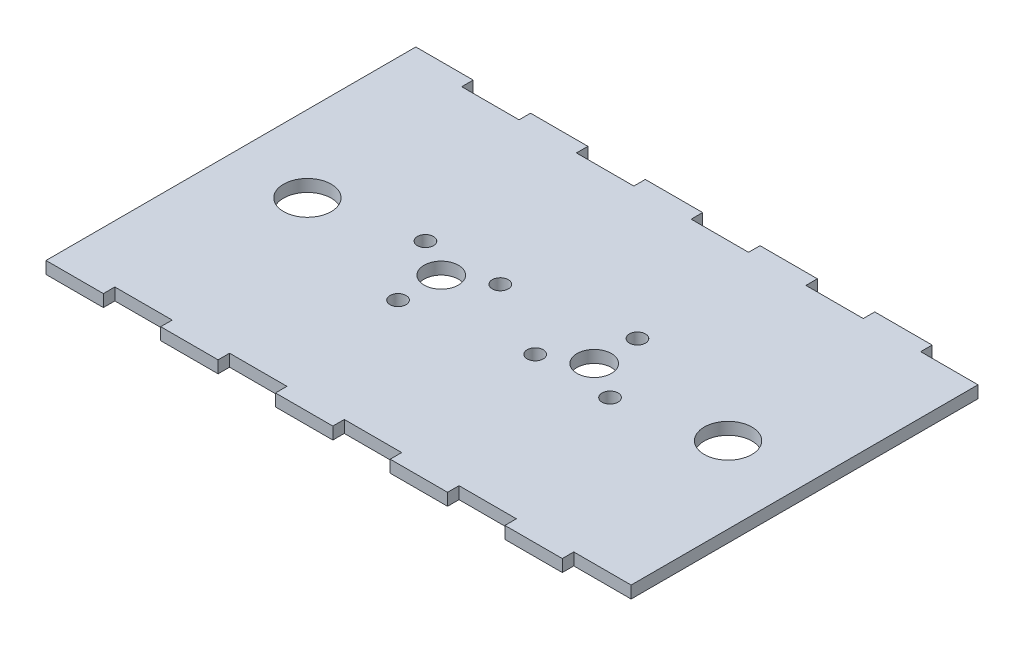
ISO-10303-21;
HEADER;
FILE_DESCRIPTION(('STEP AP214'),'2;1');
FILE_NAME('part.step','',(''),(''),'','','');
FILE_SCHEMA(('AUTOMOTIVE_DESIGN { 1 0 10303 214 1 1 1 1 }'));
ENDSEC;
DATA;
#1=APPLICATION_CONTEXT('core data for automotive mechanical design processes');
#2=APPLICATION_PROTOCOL_DEFINITION('international standard','automotive_design',2000,#1);
#3=PRODUCT_CONTEXT('',#1,'mechanical');
#4=PRODUCT('Part','Part','',(#3));
#5=PRODUCT_RELATED_PRODUCT_CATEGORY('part','',(#4));
#6=PRODUCT_DEFINITION_FORMATION('','',#4);
#7=PRODUCT_DEFINITION_CONTEXT('part definition',#1,'design');
#8=PRODUCT_DEFINITION('design','',#6,#7);
#9=PRODUCT_DEFINITION_SHAPE('','',#8);
#10=(LENGTH_UNIT() NAMED_UNIT(*) SI_UNIT(.MILLI.,.METRE.));
#11=(NAMED_UNIT(*) PLANE_ANGLE_UNIT() SI_UNIT($,.RADIAN.));
#12=(NAMED_UNIT(*) SI_UNIT($,.STERADIAN.) SOLID_ANGLE_UNIT());
#13=UNCERTAINTY_MEASURE_WITH_UNIT(LENGTH_MEASURE(1.E-05),#10,'distance_accuracy_value','');
#14=(GEOMETRIC_REPRESENTATION_CONTEXT(3) GLOBAL_UNCERTAINTY_ASSIGNED_CONTEXT((#13)) GLOBAL_UNIT_ASSIGNED_CONTEXT((#10,
#11,#12)) REPRESENTATION_CONTEXT('',''));
#15=CARTESIAN_POINT('',(0.,0.,0.));
#16=DIRECTION('',(0.,0.,1.));
#17=DIRECTION('',(1.,0.,0.));
#18=AXIS2_PLACEMENT_3D('',#15,#16,#17);
#19=CARTESIAN_POINT('',(0.,3.175,0.));
#20=DIRECTION('',(0.,0.,-1.));
#21=DIRECTION('',(-1.,0.,0.));
#22=AXIS2_PLACEMENT_3D('',#19,#20,#21);
#23=PLANE('',#22);
#24=DIRECTION('',(1.,0.,0.));
#25=VECTOR('',#24,1.);
#26=CARTESIAN_POINT('',(0.,0.,0.));
#27=LINE('',#26,#25);
#28=CARTESIAN_POINT('',(105.,0.,0.));
#29=VERTEX_POINT('',#28);
#30=CARTESIAN_POINT('',(120.,0.,0.));
#31=VERTEX_POINT('',#30);
#32=EDGE_CURVE('E662',#29,#31,#27,.T.);
#33=ORIENTED_EDGE('',*,*,#32,.T.);
#34=DIRECTION('',(0.,1.,0.));
#35=VECTOR('',#34,1.);
#36=CARTESIAN_POINT('',(120.,-15.2970585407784,0.));
#37=LINE('',#36,#35);
#38=CARTESIAN_POINT('',(120.,3.175,0.));
#39=VERTEX_POINT('',#38);
#40=EDGE_CURVE('E57',#31,#39,#37,.T.);
#41=ORIENTED_EDGE('',*,*,#40,.T.);
#42=DIRECTION('',(1.,0.,0.));
#43=VECTOR('',#42,1.);
#44=CARTESIAN_POINT('',(0.,3.175,0.));
#45=LINE('',#44,#43);
#46=CARTESIAN_POINT('',(105.,3.175,0.));
#47=VERTEX_POINT('',#46);
#48=EDGE_CURVE('E683',#47,#39,#45,.T.);
#49=ORIENTED_EDGE('',*,*,#48,.F.);
#50=DIRECTION('',(0.,1.,0.));
#51=VECTOR('',#50,1.);
#52=CARTESIAN_POINT('',(105.,-15.2970585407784,0.));
#53=LINE('',#52,#51);
#54=EDGE_CURVE('E370',#29,#47,#53,.T.);
#55=ORIENTED_EDGE('',*,*,#54,.F.);
#56=EDGE_LOOP('',(#33,#41,#49,#55));
#57=FACE_BOUND('',#56,.T.);
#58=ADVANCED_FACE('F34',(#57),#23,.F.);
#59=CARTESIAN_POINT('',(0.,3.175,-90.7));
#60=DIRECTION('',(0.,0.,1.));
#61=DIRECTION('',(1.,0.,0.));
#62=AXIS2_PLACEMENT_3D('',#59,#60,#61);
#63=PLANE('',#62);
#64=DIRECTION('',(-1.,0.,0.));
#65=VECTOR('',#64,1.);
#66=CARTESIAN_POINT('',(0.,0.,-90.7));
#67=LINE('',#66,#65);
#68=CARTESIAN_POINT('',(150.,0.,-90.7));
#69=VERTEX_POINT('',#68);
#70=CARTESIAN_POINT('',(135.,0.,-90.7));
#71=VERTEX_POINT('',#70);
#72=EDGE_CURVE('E620',#69,#71,#67,.T.);
#73=ORIENTED_EDGE('',*,*,#72,.T.);
#74=DIRECTION('',(0.,1.,0.));
#75=VECTOR('',#74,1.);
#76=CARTESIAN_POINT('',(135.,-15.2970585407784,-90.7));
#77=LINE('',#76,#75);
#78=CARTESIAN_POINT('',(135.,3.175,-90.7));
#79=VERTEX_POINT('',#78);
#80=EDGE_CURVE('E331',#71,#79,#77,.T.);
#81=ORIENTED_EDGE('',*,*,#80,.T.);
#82=DIRECTION('',(-1.,0.,0.));
#83=VECTOR('',#82,1.);
#84=CARTESIAN_POINT('',(0.,3.175,-90.7));
#85=LINE('',#84,#83);
#86=CARTESIAN_POINT('',(150.,3.175,-90.7));
#87=VERTEX_POINT('',#86);
#88=EDGE_CURVE('E628',#87,#79,#85,.T.);
#89=ORIENTED_EDGE('',*,*,#88,.F.);
#90=DIRECTION('',(0.,-1.,0.));
#91=VECTOR('',#90,1.);
#92=CARTESIAN_POINT('',(150.,3.175,-90.7));
#93=LINE('',#92,#91);
#94=EDGE_CURVE('E42',#87,#69,#93,.T.);
#95=ORIENTED_EDGE('',*,*,#94,.T.);
#96=EDGE_LOOP('',(#73,#81,#89,#95));
#97=FACE_BOUND('',#96,.T.);
#98=ADVANCED_FACE('F646',(#97),#63,.F.);
#99=CARTESIAN_POINT('',(75.,0.,0.));
#100=VERTEX_POINT('',#99);
#101=CARTESIAN_POINT('',(90.,0.,0.));
#102=VERTEX_POINT('',#101);
#103=EDGE_CURVE('E663',#100,#102,#27,.T.);
#104=ORIENTED_EDGE('',*,*,#103,.T.);
#105=DIRECTION('',(0.,1.,0.));
#106=VECTOR('',#105,1.);
#107=CARTESIAN_POINT('',(90.,-15.2970585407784,0.));
#108=LINE('',#107,#106);
#109=CARTESIAN_POINT('',(90.,3.175,0.));
#110=VERTEX_POINT('',#109);
#111=EDGE_CURVE('E377',#102,#110,#108,.T.);
#112=ORIENTED_EDGE('',*,*,#111,.T.);
#113=CARTESIAN_POINT('',(75.,3.175,0.));
#114=VERTEX_POINT('',#113);
#115=EDGE_CURVE('E681',#114,#110,#45,.T.);
#116=ORIENTED_EDGE('',*,*,#115,.F.);
#117=DIRECTION('',(0.,1.,0.));
#118=VECTOR('',#117,1.);
#119=CARTESIAN_POINT('',(75.,-15.2970585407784,0.));
#120=LINE('',#119,#118);
#121=EDGE_CURVE('E425',#100,#114,#120,.T.);
#122=ORIENTED_EDGE('',*,*,#121,.F.);
#123=EDGE_LOOP('',(#104,#112,#116,#122));
#124=FACE_BOUND('',#123,.T.);
#125=ADVANCED_FACE('F696',(#124),#23,.F.);
#126=CARTESIAN_POINT('',(120.,3.175,-90.7));
#127=VERTEX_POINT('',#126);
#128=CARTESIAN_POINT('',(105.,3.175,-90.7));
#129=VERTEX_POINT('',#128);
#130=EDGE_CURVE('E631',#127,#129,#85,.T.);
#131=ORIENTED_EDGE('',*,*,#130,.F.);
#132=DIRECTION('',(0.,1.,0.));
#133=VECTOR('',#132,1.);
#134=CARTESIAN_POINT('',(120.,-15.2970585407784,-90.7));
#135=LINE('',#134,#133);
#136=CARTESIAN_POINT('',(120.,0.,-90.7));
#137=VERTEX_POINT('',#136);
#138=EDGE_CURVE('E340',#137,#127,#135,.T.);
#139=ORIENTED_EDGE('',*,*,#138,.F.);
#140=CARTESIAN_POINT('',(105.,0.,-90.7));
#141=VERTEX_POINT('',#140);
#142=EDGE_CURVE('E640',#137,#141,#67,.T.);
#143=ORIENTED_EDGE('',*,*,#142,.T.);
#144=DIRECTION('',(0.,1.,0.));
#145=VECTOR('',#144,1.);
#146=CARTESIAN_POINT('',(105.,-15.2970585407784,-90.7));
#147=LINE('',#146,#145);
#148=EDGE_CURVE('E385',#141,#129,#147,.T.);
#149=ORIENTED_EDGE('',*,*,#148,.T.);
#150=EDGE_LOOP('',(#131,#139,#143,#149));
#151=FACE_BOUND('',#150,.T.);
#152=ADVANCED_FACE('F701',(#151),#63,.F.);
#153=CARTESIAN_POINT('',(45.,0.,0.));
#154=VERTEX_POINT('',#153);
#155=CARTESIAN_POINT('',(60.,0.,0.));
#156=VERTEX_POINT('',#155);
#157=EDGE_CURVE('E637',#154,#156,#27,.T.);
#158=ORIENTED_EDGE('',*,*,#157,.T.);
#159=DIRECTION('',(0.,1.,0.));
#160=VECTOR('',#159,1.);
#161=CARTESIAN_POINT('',(60.,-15.2970585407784,0.));
#162=LINE('',#161,#160);
#163=CARTESIAN_POINT('',(60.,3.175,0.));
#164=VERTEX_POINT('',#163);
#165=EDGE_CURVE('E432',#156,#164,#162,.T.);
#166=ORIENTED_EDGE('',*,*,#165,.T.);
#167=CARTESIAN_POINT('',(45.,3.175,0.));
#168=VERTEX_POINT('',#167);
#169=EDGE_CURVE('E625',#168,#164,#45,.T.);
#170=ORIENTED_EDGE('',*,*,#169,.F.);
#171=DIRECTION('',(0.,1.,0.));
#172=VECTOR('',#171,1.);
#173=CARTESIAN_POINT('',(45.,-15.2970585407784,0.));
#174=LINE('',#173,#172);
#175=EDGE_CURVE('E480',#154,#168,#174,.T.);
#176=ORIENTED_EDGE('',*,*,#175,.F.);
#177=EDGE_LOOP('',(#158,#166,#170,#176));
#178=FACE_BOUND('',#177,.T.);
#179=ADVANCED_FACE('F671',(#178),#23,.F.);
#180=CARTESIAN_POINT('',(90.,3.175,-90.7));
#181=VERTEX_POINT('',#180);
#182=CARTESIAN_POINT('',(75.,3.175,-90.7));
#183=VERTEX_POINT('',#182);
#184=EDGE_CURVE('E1137',#181,#183,#85,.T.);
#185=ORIENTED_EDGE('',*,*,#184,.F.);
#186=DIRECTION('',(0.,1.,0.));
#187=VECTOR('',#186,1.);
#188=CARTESIAN_POINT('',(90.,-15.2970585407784,-90.7));
#189=LINE('',#188,#187);
#190=CARTESIAN_POINT('',(90.,0.,-90.7));
#191=VERTEX_POINT('',#190);
#192=EDGE_CURVE('E394',#191,#181,#189,.T.);
#193=ORIENTED_EDGE('',*,*,#192,.F.);
#194=CARTESIAN_POINT('',(75.,0.,-90.7));
#195=VERTEX_POINT('',#194);
#196=EDGE_CURVE('E1144',#191,#195,#67,.T.);
#197=ORIENTED_EDGE('',*,*,#196,.T.);
#198=DIRECTION('',(0.,1.,0.));
#199=VECTOR('',#198,1.);
#200=CARTESIAN_POINT('',(75.,-15.2970585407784,-90.7));
#201=LINE('',#200,#199);
#202=EDGE_CURVE('E440',#195,#183,#201,.T.);
#203=ORIENTED_EDGE('',*,*,#202,.T.);
#204=EDGE_LOOP('',(#185,#193,#197,#203));
#205=FACE_BOUND('',#204,.T.);
#206=ADVANCED_FACE('F714',(#205),#63,.F.);
#207=CARTESIAN_POINT('',(15.,0.,0.));
#208=VERTEX_POINT('',#207);
#209=CARTESIAN_POINT('',(30.,0.,0.));
#210=VERTEX_POINT('',#209);
#211=EDGE_CURVE('E634',#208,#210,#27,.T.);
#212=ORIENTED_EDGE('',*,*,#211,.T.);
#213=DIRECTION('',(0.,1.,0.));
#214=VECTOR('',#213,1.);
#215=CARTESIAN_POINT('',(30.,-15.2970585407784,0.));
#216=LINE('',#215,#214);
#217=CARTESIAN_POINT('',(30.,3.175,0.));
#218=VERTEX_POINT('',#217);
#219=EDGE_CURVE('E487',#210,#218,#216,.T.);
#220=ORIENTED_EDGE('',*,*,#219,.T.);
#221=CARTESIAN_POINT('',(15.,3.175,0.));
#222=VERTEX_POINT('',#221);
#223=EDGE_CURVE('E621',#222,#218,#45,.T.);
#224=ORIENTED_EDGE('',*,*,#223,.F.);
#225=DIRECTION('',(0.,1.,0.));
#226=VECTOR('',#225,1.);
#227=CARTESIAN_POINT('',(15.,-15.2970585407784,0.));
#228=LINE('',#227,#226);
#229=EDGE_CURVE('E527',#208,#222,#228,.T.);
#230=ORIENTED_EDGE('',*,*,#229,.F.);
#231=EDGE_LOOP('',(#212,#220,#224,#230));
#232=FACE_BOUND('',#231,.T.);
#233=ADVANCED_FACE('F707',(#232),#23,.F.);
#234=CARTESIAN_POINT('',(60.,3.175,-90.7));
#235=VERTEX_POINT('',#234);
#236=CARTESIAN_POINT('',(45.,3.175,-90.7));
#237=VERTEX_POINT('',#236);
#238=EDGE_CURVE('E1148',#235,#237,#85,.T.);
#239=ORIENTED_EDGE('',*,*,#238,.F.);
#240=DIRECTION('',(0.,1.,0.));
#241=VECTOR('',#240,1.);
#242=CARTESIAN_POINT('',(60.,-15.2970585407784,-90.7));
#243=LINE('',#242,#241);
#244=CARTESIAN_POINT('',(60.,0.,-90.7));
#245=VERTEX_POINT('',#244);
#246=EDGE_CURVE('E449',#245,#235,#243,.T.);
#247=ORIENTED_EDGE('',*,*,#246,.F.);
#248=CARTESIAN_POINT('',(45.,0.,-90.7));
#249=VERTEX_POINT('',#248);
#250=EDGE_CURVE('E1159',#245,#249,#67,.T.);
#251=ORIENTED_EDGE('',*,*,#250,.T.);
#252=DIRECTION('',(0.,1.,0.));
#253=VECTOR('',#252,1.);
#254=CARTESIAN_POINT('',(45.,-15.2970585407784,-90.7));
#255=LINE('',#254,#253);
#256=EDGE_CURVE('E495',#249,#237,#255,.T.);
#257=ORIENTED_EDGE('',*,*,#256,.T.);
#258=EDGE_LOOP('',(#239,#247,#251,#257));
#259=FACE_BOUND('',#258,.T.);
#260=ADVANCED_FACE('F706',(#259),#63,.F.);
#261=CARTESIAN_POINT('',(135.,3.175,0.));
#262=VERTEX_POINT('',#261);
#263=CARTESIAN_POINT('',(150.,3.175,0.));
#264=VERTEX_POINT('',#263);
#265=EDGE_CURVE('E49',#262,#264,#45,.T.);
#266=ORIENTED_EDGE('',*,*,#265,.F.);
#267=DIRECTION('',(0.,1.,0.));
#268=VECTOR('',#267,1.);
#269=CARTESIAN_POINT('',(135.,-15.2970585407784,0.));
#270=LINE('',#269,#268);
#271=CARTESIAN_POINT('',(135.,0.,0.));
#272=VERTEX_POINT('',#271);
#273=EDGE_CURVE('E322',#272,#262,#270,.T.);
#274=ORIENTED_EDGE('',*,*,#273,.F.);
#275=CARTESIAN_POINT('',(150.,0.,0.));
#276=VERTEX_POINT('',#275);
#277=EDGE_CURVE('E633',#272,#276,#27,.T.);
#278=ORIENTED_EDGE('',*,*,#277,.T.);
#279=DIRECTION('',(0.,-1.,0.));
#280=VECTOR('',#279,1.);
#281=CARTESIAN_POINT('',(150.,3.175,0.));
#282=LINE('',#281,#280);
#283=EDGE_CURVE('E11',#264,#276,#282,.T.);
#284=ORIENTED_EDGE('',*,*,#283,.F.);
#285=EDGE_LOOP('',(#266,#274,#278,#284));
#286=FACE_BOUND('',#285,.T.);
#287=ADVANCED_FACE('F661',(#286),#23,.F.);
#288=CARTESIAN_POINT('',(0.,3.175,0.));
#289=DIRECTION('',(0.,-1.,0.));
#290=DIRECTION('',(0.,0.,-1.));
#291=AXIS2_PLACEMENT_3D('',#288,#289,#290);
#292=PLANE('',#291);
#293=DIRECTION('',(0.,0.,1.));
#294=VECTOR('',#293,1.);
#295=CARTESIAN_POINT('',(0.,3.175,0.));
#296=LINE('',#295,#294);
#297=CARTESIAN_POINT('',(0.,3.175,-93.7));
#298=VERTEX_POINT('',#297);
#299=CARTESIAN_POINT('',(0.,3.175,3.));
#300=VERTEX_POINT('',#299);
#301=EDGE_CURVE('E618',#298,#300,#296,.T.);
#302=ORIENTED_EDGE('',*,*,#301,.T.);
#303=DIRECTION('',(1.,0.,0.));
#304=VECTOR('',#303,1.);
#305=CARTESIAN_POINT('',(0.,3.175,3.));
#306=LINE('',#305,#304);
#307=CARTESIAN_POINT('',(15.,3.175,3.));
#308=VERTEX_POINT('',#307);
#309=EDGE_CURVE('E517',#300,#308,#306,.T.);
#310=ORIENTED_EDGE('',*,*,#309,.T.);
#311=DIRECTION('',(0.,0.,-1.));
#312=VECTOR('',#311,1.);
#313=CARTESIAN_POINT('',(15.,3.175,0.));
#314=LINE('',#313,#312);
#315=EDGE_CURVE('E518',#308,#222,#314,.T.);
#316=ORIENTED_EDGE('',*,*,#315,.T.);
#317=ORIENTED_EDGE('',*,*,#223,.T.);
#318=DIRECTION('',(0.,0.,1.));
#319=VECTOR('',#318,1.);
#320=CARTESIAN_POINT('',(30.,3.175,0.));
#321=LINE('',#320,#319);
#322=CARTESIAN_POINT('',(30.,3.175,3.));
#323=VERTEX_POINT('',#322);
#324=EDGE_CURVE('E464',#218,#323,#321,.T.);
#325=ORIENTED_EDGE('',*,*,#324,.T.);
#326=DIRECTION('',(1.,0.,0.));
#327=VECTOR('',#326,1.);
#328=CARTESIAN_POINT('',(30.,3.175,3.));
#329=LINE('',#328,#327);
#330=CARTESIAN_POINT('',(45.,3.175,3.));
#331=VERTEX_POINT('',#330);
#332=EDGE_CURVE('E469',#323,#331,#329,.T.);
#333=ORIENTED_EDGE('',*,*,#332,.T.);
#334=DIRECTION('',(0.,0.,-1.));
#335=VECTOR('',#334,1.);
#336=CARTESIAN_POINT('',(45.,3.175,0.));
#337=LINE('',#336,#335);
#338=EDGE_CURVE('E465',#331,#168,#337,.T.);
#339=ORIENTED_EDGE('',*,*,#338,.T.);
#340=ORIENTED_EDGE('',*,*,#169,.T.);
#341=DIRECTION('',(0.,0.,1.));
#342=VECTOR('',#341,1.);
#343=CARTESIAN_POINT('',(60.,3.175,0.));
#344=LINE('',#343,#342);
#345=CARTESIAN_POINT('',(60.,3.175,3.));
#346=VERTEX_POINT('',#345);
#347=EDGE_CURVE('E409',#164,#346,#344,.T.);
#348=ORIENTED_EDGE('',*,*,#347,.T.);
#349=DIRECTION('',(1.,0.,0.));
#350=VECTOR('',#349,1.);
#351=CARTESIAN_POINT('',(60.,3.175,3.));
#352=LINE('',#351,#350);
#353=CARTESIAN_POINT('',(75.,3.175,3.));
#354=VERTEX_POINT('',#353);
#355=EDGE_CURVE('E414',#346,#354,#352,.T.);
#356=ORIENTED_EDGE('',*,*,#355,.T.);
#357=DIRECTION('',(0.,0.,-1.));
#358=VECTOR('',#357,1.);
#359=CARTESIAN_POINT('',(75.,3.175,0.));
#360=LINE('',#359,#358);
#361=EDGE_CURVE('E410',#354,#114,#360,.T.);
#362=ORIENTED_EDGE('',*,*,#361,.T.);
#363=ORIENTED_EDGE('',*,*,#115,.T.);
#364=DIRECTION('',(0.,0.,1.));
#365=VECTOR('',#364,1.);
#366=CARTESIAN_POINT('',(90.,3.175,0.));
#367=LINE('',#366,#365);
#368=CARTESIAN_POINT('',(90.,3.175,3.));
#369=VERTEX_POINT('',#368);
#370=EDGE_CURVE('E354',#110,#369,#367,.T.);
#371=ORIENTED_EDGE('',*,*,#370,.T.);
#372=DIRECTION('',(1.,0.,0.));
#373=VECTOR('',#372,1.);
#374=CARTESIAN_POINT('',(90.,3.175,3.));
#375=LINE('',#374,#373);
#376=CARTESIAN_POINT('',(105.,3.175,3.));
#377=VERTEX_POINT('',#376);
#378=EDGE_CURVE('E359',#369,#377,#375,.T.);
#379=ORIENTED_EDGE('',*,*,#378,.T.);
#380=DIRECTION('',(0.,0.,-1.));
#381=VECTOR('',#380,1.);
#382=CARTESIAN_POINT('',(105.,3.175,0.));
#383=LINE('',#382,#381);
#384=EDGE_CURVE('E355',#377,#47,#383,.T.);
#385=ORIENTED_EDGE('',*,*,#384,.T.);
#386=ORIENTED_EDGE('',*,*,#48,.T.);
#387=DIRECTION('',(0.,0.,1.));
#388=VECTOR('',#387,1.);
#389=CARTESIAN_POINT('',(120.,3.175,0.));
#390=LINE('',#389,#388);
#391=CARTESIAN_POINT('',(120.,3.175,3.));
#392=VERTEX_POINT('',#391);
#393=EDGE_CURVE('E320',#39,#392,#390,.T.);
#394=ORIENTED_EDGE('',*,*,#393,.T.);
#395=DIRECTION('',(1.,0.,0.));
#396=VECTOR('',#395,1.);
#397=CARTESIAN_POINT('',(120.,3.175,3.));
#398=LINE('',#397,#396);
#399=CARTESIAN_POINT('',(135.,3.175,3.));
#400=VERTEX_POINT('',#399);
#401=EDGE_CURVE('E308',#392,#400,#398,.T.);
#402=ORIENTED_EDGE('',*,*,#401,.T.);
#403=DIRECTION('',(0.,0.,-1.));
#404=VECTOR('',#403,1.);
#405=CARTESIAN_POINT('',(135.,3.175,0.));
#406=LINE('',#405,#404);
#407=EDGE_CURVE('E314',#400,#262,#406,.T.);
#408=ORIENTED_EDGE('',*,*,#407,.T.);
#409=ORIENTED_EDGE('',*,*,#265,.T.);
#410=DIRECTION('',(0.,0.,-1.));
#411=VECTOR('',#410,1.);
#412=CARTESIAN_POINT('',(150.,3.175,0.));
#413=LINE('',#412,#411);
#414=EDGE_CURVE('E624',#264,#87,#413,.T.);
#415=ORIENTED_EDGE('',*,*,#414,.T.);
#416=ORIENTED_EDGE('',*,*,#88,.T.);
#417=DIRECTION('',(0.,0.,-1.));
#418=VECTOR('',#417,1.);
#419=CARTESIAN_POINT('',(135.,3.175,-90.7));
#420=LINE('',#419,#418);
#421=CARTESIAN_POINT('',(135.,3.175,-93.7));
#422=VERTEX_POINT('',#421);
#423=EDGE_CURVE('E332',#79,#422,#420,.T.);
#424=ORIENTED_EDGE('',*,*,#423,.T.);
#425=DIRECTION('',(-1.,0.,0.));
#426=VECTOR('',#425,1.);
#427=CARTESIAN_POINT('',(120.,3.175,-93.7));
#428=LINE('',#427,#426);
#429=CARTESIAN_POINT('',(120.,3.175,-93.7));
#430=VERTEX_POINT('',#429);
#431=EDGE_CURVE('E328',#422,#430,#428,.T.);
#432=ORIENTED_EDGE('',*,*,#431,.T.);
#433=DIRECTION('',(0.,0.,1.));
#434=VECTOR('',#433,1.);
#435=CARTESIAN_POINT('',(120.,3.175,-90.7));
#436=LINE('',#435,#434);
#437=EDGE_CURVE('E327',#430,#127,#436,.T.);
#438=ORIENTED_EDGE('',*,*,#437,.T.);
#439=ORIENTED_EDGE('',*,*,#130,.T.);
#440=DIRECTION('',(0.,0.,-1.));
#441=VECTOR('',#440,1.);
#442=CARTESIAN_POINT('',(105.,3.175,-90.7));
#443=LINE('',#442,#441);
#444=CARTESIAN_POINT('',(105.,3.175,-93.7));
#445=VERTEX_POINT('',#444);
#446=EDGE_CURVE('E386',#129,#445,#443,.T.);
#447=ORIENTED_EDGE('',*,*,#446,.T.);
#448=DIRECTION('',(-1.,0.,0.));
#449=VECTOR('',#448,1.);
#450=CARTESIAN_POINT('',(90.,3.175,-93.7));
#451=LINE('',#450,#449);
#452=CARTESIAN_POINT('',(90.,3.175,-93.7));
#453=VERTEX_POINT('',#452);
#454=EDGE_CURVE('E382',#445,#453,#451,.T.);
#455=ORIENTED_EDGE('',*,*,#454,.T.);
#456=DIRECTION('',(0.,0.,1.));
#457=VECTOR('',#456,1.);
#458=CARTESIAN_POINT('',(90.,3.175,-90.7));
#459=LINE('',#458,#457);
#460=EDGE_CURVE('E381',#453,#181,#459,.T.);
#461=ORIENTED_EDGE('',*,*,#460,.T.);
#462=ORIENTED_EDGE('',*,*,#184,.T.);
#463=DIRECTION('',(0.,0.,-1.));
#464=VECTOR('',#463,1.);
#465=CARTESIAN_POINT('',(75.,3.175,-90.7));
#466=LINE('',#465,#464);
#467=CARTESIAN_POINT('',(75.,3.175,-93.7));
#468=VERTEX_POINT('',#467);
#469=EDGE_CURVE('E441',#183,#468,#466,.T.);
#470=ORIENTED_EDGE('',*,*,#469,.T.);
#471=DIRECTION('',(-1.,0.,0.));
#472=VECTOR('',#471,1.);
#473=CARTESIAN_POINT('',(60.,3.175,-93.7));
#474=LINE('',#473,#472);
#475=CARTESIAN_POINT('',(60.,3.175,-93.7));
#476=VERTEX_POINT('',#475);
#477=EDGE_CURVE('E437',#468,#476,#474,.T.);
#478=ORIENTED_EDGE('',*,*,#477,.T.);
#479=DIRECTION('',(0.,0.,1.));
#480=VECTOR('',#479,1.);
#481=CARTESIAN_POINT('',(60.,3.175,-90.7));
#482=LINE('',#481,#480);
#483=EDGE_CURVE('E436',#476,#235,#482,.T.);
#484=ORIENTED_EDGE('',*,*,#483,.T.);
#485=ORIENTED_EDGE('',*,*,#238,.T.);
#486=DIRECTION('',(0.,0.,-1.));
#487=VECTOR('',#486,1.);
#488=CARTESIAN_POINT('',(45.,3.175,-90.7));
#489=LINE('',#488,#487);
#490=CARTESIAN_POINT('',(45.,3.175,-93.7));
#491=VERTEX_POINT('',#490);
#492=EDGE_CURVE('E496',#237,#491,#489,.T.);
#493=ORIENTED_EDGE('',*,*,#492,.T.);
#494=DIRECTION('',(-1.,0.,0.));
#495=VECTOR('',#494,1.);
#496=CARTESIAN_POINT('',(30.,3.175,-93.7));
#497=LINE('',#496,#495);
#498=CARTESIAN_POINT('',(30.,3.175,-93.7));
#499=VERTEX_POINT('',#498);
#500=EDGE_CURVE('E492',#491,#499,#497,.T.);
#501=ORIENTED_EDGE('',*,*,#500,.T.);
#502=DIRECTION('',(0.,0.,1.));
#503=VECTOR('',#502,1.);
#504=CARTESIAN_POINT('',(30.,3.175,-90.7));
#505=LINE('',#504,#503);
#506=CARTESIAN_POINT('',(30.,3.175,-90.7));
#507=VERTEX_POINT('',#506);
#508=EDGE_CURVE('E491',#499,#507,#505,.T.);
#509=ORIENTED_EDGE('',*,*,#508,.T.);
#510=CARTESIAN_POINT('',(15.,3.175,-90.7));
#511=VERTEX_POINT('',#510);
#512=EDGE_CURVE('E627',#507,#511,#85,.T.);
#513=ORIENTED_EDGE('',*,*,#512,.T.);
#514=DIRECTION('',(0.,0.,-1.));
#515=VECTOR('',#514,1.);
#516=CARTESIAN_POINT('',(15.,3.175,-90.7));
#517=LINE('',#516,#515);
#518=CARTESIAN_POINT('',(15.,3.175,-93.7));
#519=VERTEX_POINT('',#518);
#520=EDGE_CURVE('E534',#511,#519,#517,.T.);
#521=ORIENTED_EDGE('',*,*,#520,.T.);
#522=DIRECTION('',(-1.,0.,0.));
#523=VECTOR('',#522,1.);
#524=CARTESIAN_POINT('',(0.,3.175,-93.7));
#525=LINE('',#524,#523);
#526=EDGE_CURVE('E538',#519,#298,#525,.T.);
#527=ORIENTED_EDGE('',*,*,#526,.T.);
#528=EDGE_LOOP('',(#302,#310,#316,#317,#325,#333,#339,#340,#348,#356,#362,#363,#371,#379,#385,
#386,#394,#402,#408,#409,#415,#416,#424,#432,#438,#439,#447,#455,#461,#462,#470,#478,#484,#485,
#493,#501,#509,#513,#521,#527));
#529=FACE_BOUND('',#528,.T.);
#530=CARTESIAN_POINT('',(95.,3.175,-45.35));
#531=DIRECTION('',(0.,1.,0.));
#532=DIRECTION('',(0.,0.,1.));
#533=AXIS2_PLACEMENT_3D('',#530,#531,#532);
#534=CIRCLE('',#533,4.50000000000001);
#535=CARTESIAN_POINT('',(95.,3.175,-40.85));
#536=VERTEX_POINT('',#535);
#537=EDGE_CURVE('E612',#536,#536,#534,.T.);
#538=ORIENTED_EDGE('',*,*,#537,.F.);
#539=EDGE_LOOP('',(#538));
#540=FACE_BOUND('',#539,.T.);
#541=CARTESIAN_POINT('',(95.,3.175,-56.65));
#542=DIRECTION('',(0.,1.,0.));
#543=DIRECTION('',(0.,0.,1.));
#544=AXIS2_PLACEMENT_3D('',#541,#542,#543);
#545=CIRCLE('',#544,2.1);
#546=CARTESIAN_POINT('',(95.,3.175,-54.55));
#547=VERTEX_POINT('',#546);
#548=EDGE_CURVE('E606',#547,#547,#545,.T.);
#549=ORIENTED_EDGE('',*,*,#548,.F.);
#550=EDGE_LOOP('',(#549));
#551=FACE_BOUND('',#550,.T.);
#552=CARTESIAN_POINT('',(85.2139129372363,3.175,-39.6999999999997));
#553=DIRECTION('',(0.,1.,0.));
#554=DIRECTION('',(0.,0.,1.));
#555=AXIS2_PLACEMENT_3D('',#552,#553,#554);
#556=CIRCLE('',#555,2.1);
#557=CARTESIAN_POINT('',(85.2139129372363,3.175,-37.5999999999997));
#558=VERTEX_POINT('',#557);
#559=EDGE_CURVE('E600',#558,#558,#556,.T.);
#560=ORIENTED_EDGE('',*,*,#559,.F.);
#561=EDGE_LOOP('',(#560));
#562=FACE_BOUND('',#561,.T.);
#563=CARTESIAN_POINT('',(104.786087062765,3.175,-39.7000000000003));
#564=DIRECTION('',(0.,1.,0.));
#565=DIRECTION('',(0.,0.,1.));
#566=AXIS2_PLACEMENT_3D('',#563,#564,#565);
#567=CIRCLE('',#566,2.1);
#568=CARTESIAN_POINT('',(104.786087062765,3.175,-37.6000000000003));
#569=VERTEX_POINT('',#568);
#570=EDGE_CURVE('E594',#569,#569,#567,.T.);
#571=ORIENTED_EDGE('',*,*,#570,.F.);
#572=EDGE_LOOP('',(#571));
#573=FACE_BOUND('',#572,.T.);
#574=CARTESIAN_POINT('',(55.,3.175,-45.35));
#575=DIRECTION('',(0.,1.,0.));
#576=DIRECTION('',(0.,0.,1.));
#577=AXIS2_PLACEMENT_3D('',#574,#575,#576);
#578=CIRCLE('',#577,4.5);
#579=CARTESIAN_POINT('',(55.,3.175,-40.85));
#580=VERTEX_POINT('',#579);
#581=EDGE_CURVE('E588',#580,#580,#578,.T.);
#582=ORIENTED_EDGE('',*,*,#581,.F.);
#583=EDGE_LOOP('',(#582));
#584=FACE_BOUND('',#583,.T.);
#585=CARTESIAN_POINT('',(55.,3.175,-34.05));
#586=DIRECTION('',(0.,1.,0.));
#587=DIRECTION('',(0.,0.,1.));
#588=AXIS2_PLACEMENT_3D('',#585,#586,#587);
#589=CIRCLE('',#588,2.1);
#590=CARTESIAN_POINT('',(55.,3.175,-31.95));
#591=VERTEX_POINT('',#590);
#592=EDGE_CURVE('E582',#591,#591,#589,.T.);
#593=ORIENTED_EDGE('',*,*,#592,.F.);
#594=EDGE_LOOP('',(#593));
#595=FACE_BOUND('',#594,.T.);
#596=CARTESIAN_POINT('',(20.,3.175,-45.35));
#597=DIRECTION('',(0.,1.,0.));
#598=DIRECTION('',(0.,0.,1.));
#599=AXIS2_PLACEMENT_3D('',#596,#597,#598);
#600=CIRCLE('',#599,6.225);
#601=CARTESIAN_POINT('',(20.,3.175,-39.125));
#602=VERTEX_POINT('',#601);
#603=EDGE_CURVE('E576',#602,#602,#600,.T.);
#604=ORIENTED_EDGE('',*,*,#603,.F.);
#605=EDGE_LOOP('',(#604));
#606=FACE_BOUND('',#605,.T.);
#607=CARTESIAN_POINT('',(45.2139129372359,3.175,-51.));
#608=DIRECTION('',(0.,1.,0.));
#609=DIRECTION('',(0.,0.,1.));
#610=AXIS2_PLACEMENT_3D('',#607,#608,#609);
#611=CIRCLE('',#610,2.1);
#612=CARTESIAN_POINT('',(45.2139129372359,3.175,-48.9));
#613=VERTEX_POINT('',#612);
#614=EDGE_CURVE('E570',#613,#613,#611,.T.);
#615=ORIENTED_EDGE('',*,*,#614,.F.);
#616=EDGE_LOOP('',(#615));
#617=FACE_BOUND('',#616,.T.);
#618=CARTESIAN_POINT('',(64.7860870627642,3.175,-50.9999999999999));
#619=DIRECTION('',(0.,1.,0.));
#620=DIRECTION('',(0.,0.,1.));
#621=AXIS2_PLACEMENT_3D('',#618,#619,#620);
#622=CIRCLE('',#621,2.1);
#623=CARTESIAN_POINT('',(64.7860870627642,3.175,-48.8999999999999));
#624=VERTEX_POINT('',#623);
#625=EDGE_CURVE('E564',#624,#624,#622,.T.);
#626=ORIENTED_EDGE('',*,*,#625,.F.);
#627=EDGE_LOOP('',(#626));
#628=FACE_BOUND('',#627,.T.);
#629=CARTESIAN_POINT('',(130.,3.175,-45.35));
#630=DIRECTION('',(0.,1.,0.));
#631=DIRECTION('',(0.,0.,1.));
#632=AXIS2_PLACEMENT_3D('',#629,#630,#631);
#633=CIRCLE('',#632,6.22500000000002);
#634=CARTESIAN_POINT('',(130.,3.175,-39.125));
#635=VERTEX_POINT('',#634);
#636=EDGE_CURVE('E558',#635,#635,#633,.T.);
#637=ORIENTED_EDGE('',*,*,#636,.F.);
#638=EDGE_LOOP('',(#637));
#639=FACE_BOUND('',#638,.T.);
#640=ADVANCED_FACE('F657',(#529,#540,#551,#562,#573,#584,#595,#606,#617,#628,#639),#292,.F.);
#641=CARTESIAN_POINT('',(0.,0.,0.));
#642=DIRECTION('',(0.,-1.,0.));
#643=DIRECTION('',(0.,0.,-1.));
#644=AXIS2_PLACEMENT_3D('',#641,#642,#643);
#645=PLANE('',#644);
#646=CARTESIAN_POINT('',(64.7860870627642,0.,-50.9999999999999));
#647=DIRECTION('',(0.,1.,0.));
#648=DIRECTION('',(0.,0.,1.));
#649=AXIS2_PLACEMENT_3D('',#646,#647,#648);
#650=CIRCLE('',#649,2.1);
#651=CARTESIAN_POINT('',(64.7860870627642,0.,-48.8999999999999));
#652=VERTEX_POINT('',#651);
#653=EDGE_CURVE('E561',#652,#652,#650,.T.);
#654=ORIENTED_EDGE('',*,*,#653,.T.);
#655=EDGE_LOOP('',(#654));
#656=FACE_BOUND('',#655,.T.);
#657=CARTESIAN_POINT('',(20.,0.,-45.35));
#658=DIRECTION('',(0.,1.,0.));
#659=DIRECTION('',(0.,0.,1.));
#660=AXIS2_PLACEMENT_3D('',#657,#658,#659);
#661=CIRCLE('',#660,6.225);
#662=CARTESIAN_POINT('',(20.,0.,-39.125));
#663=VERTEX_POINT('',#662);
#664=EDGE_CURVE('E573',#663,#663,#661,.T.);
#665=ORIENTED_EDGE('',*,*,#664,.T.);
#666=EDGE_LOOP('',(#665));
#667=FACE_BOUND('',#666,.T.);
#668=CARTESIAN_POINT('',(55.,0.,-45.35));
#669=DIRECTION('',(0.,1.,0.));
#670=DIRECTION('',(0.,0.,1.));
#671=AXIS2_PLACEMENT_3D('',#668,#669,#670);
#672=CIRCLE('',#671,4.5);
#673=CARTESIAN_POINT('',(55.,0.,-40.85));
#674=VERTEX_POINT('',#673);
#675=EDGE_CURVE('E585',#674,#674,#672,.T.);
#676=ORIENTED_EDGE('',*,*,#675,.T.);
#677=EDGE_LOOP('',(#676));
#678=FACE_BOUND('',#677,.T.);
#679=CARTESIAN_POINT('',(85.2139129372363,0.,-39.6999999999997));
#680=DIRECTION('',(0.,1.,0.));
#681=DIRECTION('',(0.,0.,1.));
#682=AXIS2_PLACEMENT_3D('',#679,#680,#681);
#683=CIRCLE('',#682,2.1);
#684=CARTESIAN_POINT('',(85.2139129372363,0.,-37.5999999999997));
#685=VERTEX_POINT('',#684);
#686=EDGE_CURVE('E597',#685,#685,#683,.T.);
#687=ORIENTED_EDGE('',*,*,#686,.T.);
#688=EDGE_LOOP('',(#687));
#689=FACE_BOUND('',#688,.T.);
#690=CARTESIAN_POINT('',(95.,0.,-45.35));
#691=DIRECTION('',(0.,1.,0.));
#692=DIRECTION('',(0.,0.,1.));
#693=AXIS2_PLACEMENT_3D('',#690,#691,#692);
#694=CIRCLE('',#693,4.50000000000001);
#695=CARTESIAN_POINT('',(95.,0.,-40.85));
#696=VERTEX_POINT('',#695);
#697=EDGE_CURVE('E609',#696,#696,#694,.T.);
#698=ORIENTED_EDGE('',*,*,#697,.T.);
#699=EDGE_LOOP('',(#698));
#700=FACE_BOUND('',#699,.T.);
#701=DIRECTION('',(0.,0.,1.));
#702=VECTOR('',#701,1.);
#703=CARTESIAN_POINT('',(0.,0.,0.));
#704=LINE('',#703,#702);
#705=CARTESIAN_POINT('',(0.,0.,-93.7));
#706=VERTEX_POINT('',#705);
#707=CARTESIAN_POINT('',(0.,0.,3.));
#708=VERTEX_POINT('',#707);
#709=EDGE_CURVE('E615',#706,#708,#704,.T.);
#710=ORIENTED_EDGE('',*,*,#709,.F.);
#711=DIRECTION('',(-1.,0.,0.));
#712=VECTOR('',#711,1.);
#713=CARTESIAN_POINT('',(0.,0.,-93.7));
#714=LINE('',#713,#712);
#715=CARTESIAN_POINT('',(15.,0.,-93.7));
#716=VERTEX_POINT('',#715);
#717=EDGE_CURVE('E544',#716,#706,#714,.T.);
#718=ORIENTED_EDGE('',*,*,#717,.F.);
#719=DIRECTION('',(0.,0.,-1.));
#720=VECTOR('',#719,1.);
#721=CARTESIAN_POINT('',(15.,0.,-90.7));
#722=LINE('',#721,#720);
#723=CARTESIAN_POINT('',(15.,0.,-90.7));
#724=VERTEX_POINT('',#723);
#725=EDGE_CURVE('E549',#724,#716,#722,.T.);
#726=ORIENTED_EDGE('',*,*,#725,.F.);
#727=CARTESIAN_POINT('',(30.,0.,-90.7));
#728=VERTEX_POINT('',#727);
#729=EDGE_CURVE('E639',#728,#724,#67,.T.);
#730=ORIENTED_EDGE('',*,*,#729,.F.);
#731=DIRECTION('',(0.,0.,1.));
#732=VECTOR('',#731,1.);
#733=CARTESIAN_POINT('',(30.,0.,-90.7));
#734=LINE('',#733,#732);
#735=CARTESIAN_POINT('',(30.,0.,-93.7));
#736=VERTEX_POINT('',#735);
#737=EDGE_CURVE('E501',#736,#728,#734,.T.);
#738=ORIENTED_EDGE('',*,*,#737,.F.);
#739=DIRECTION('',(-1.,0.,0.));
#740=VECTOR('',#739,1.);
#741=CARTESIAN_POINT('',(30.,0.,-93.7));
#742=LINE('',#741,#740);
#743=CARTESIAN_POINT('',(45.,0.,-93.7));
#744=VERTEX_POINT('',#743);
#745=EDGE_CURVE('E505',#744,#736,#742,.T.);
#746=ORIENTED_EDGE('',*,*,#745,.F.);
#747=DIRECTION('',(0.,0.,-1.));
#748=VECTOR('',#747,1.);
#749=CARTESIAN_POINT('',(45.,0.,-90.7));
#750=LINE('',#749,#748);
#751=EDGE_CURVE('E509',#249,#744,#750,.T.);
#752=ORIENTED_EDGE('',*,*,#751,.F.);
#753=ORIENTED_EDGE('',*,*,#250,.F.);
#754=DIRECTION('',(0.,0.,1.));
#755=VECTOR('',#754,1.);
#756=CARTESIAN_POINT('',(60.,0.,-90.7));
#757=LINE('',#756,#755);
#758=CARTESIAN_POINT('',(60.,0.,-93.7));
#759=VERTEX_POINT('',#758);
#760=EDGE_CURVE('E446',#759,#245,#757,.T.);
#761=ORIENTED_EDGE('',*,*,#760,.F.);
#762=DIRECTION('',(-1.,0.,0.));
#763=VECTOR('',#762,1.);
#764=CARTESIAN_POINT('',(60.,0.,-93.7));
#765=LINE('',#764,#763);
#766=CARTESIAN_POINT('',(75.,0.,-93.7));
#767=VERTEX_POINT('',#766);
#768=EDGE_CURVE('E451',#767,#759,#765,.T.);
#769=ORIENTED_EDGE('',*,*,#768,.F.);
#770=DIRECTION('',(0.,0.,-1.));
#771=VECTOR('',#770,1.);
#772=CARTESIAN_POINT('',(75.,0.,-90.7));
#773=LINE('',#772,#771);
#774=EDGE_CURVE('E455',#195,#767,#773,.T.);
#775=ORIENTED_EDGE('',*,*,#774,.F.);
#776=ORIENTED_EDGE('',*,*,#196,.F.);
#777=DIRECTION('',(0.,0.,1.));
#778=VECTOR('',#777,1.);
#779=CARTESIAN_POINT('',(90.,0.,-90.7));
#780=LINE('',#779,#778);
#781=CARTESIAN_POINT('',(90.,0.,-93.7));
#782=VERTEX_POINT('',#781);
#783=EDGE_CURVE('E391',#782,#191,#780,.T.);
#784=ORIENTED_EDGE('',*,*,#783,.F.);
#785=DIRECTION('',(-1.,0.,0.));
#786=VECTOR('',#785,1.);
#787=CARTESIAN_POINT('',(90.,0.,-93.7));
#788=LINE('',#787,#786);
#789=CARTESIAN_POINT('',(105.,0.,-93.7));
#790=VERTEX_POINT('',#789);
#791=EDGE_CURVE('E396',#790,#782,#788,.T.);
#792=ORIENTED_EDGE('',*,*,#791,.F.);
#793=DIRECTION('',(0.,0.,-1.));
#794=VECTOR('',#793,1.);
#795=CARTESIAN_POINT('',(105.,0.,-90.7));
#796=LINE('',#795,#794);
#797=EDGE_CURVE('E400',#141,#790,#796,.T.);
#798=ORIENTED_EDGE('',*,*,#797,.F.);
#799=ORIENTED_EDGE('',*,*,#142,.F.);
#800=DIRECTION('',(0.,0.,1.));
#801=VECTOR('',#800,1.);
#802=CARTESIAN_POINT('',(120.,0.,-90.7));
#803=LINE('',#802,#801);
#804=CARTESIAN_POINT('',(120.,0.,-93.7));
#805=VERTEX_POINT('',#804);
#806=EDGE_CURVE('E337',#805,#137,#803,.T.);
#807=ORIENTED_EDGE('',*,*,#806,.F.);
#808=DIRECTION('',(-1.,0.,0.));
#809=VECTOR('',#808,1.);
#810=CARTESIAN_POINT('',(120.,0.,-93.7));
#811=LINE('',#810,#809);
#812=CARTESIAN_POINT('',(135.,0.,-93.7));
#813=VERTEX_POINT('',#812);
#814=EDGE_CURVE('E342',#813,#805,#811,.T.);
#815=ORIENTED_EDGE('',*,*,#814,.F.);
#816=DIRECTION('',(0.,0.,-1.));
#817=VECTOR('',#816,1.);
#818=CARTESIAN_POINT('',(135.,0.,-90.7));
#819=LINE('',#818,#817);
#820=EDGE_CURVE('E346',#71,#813,#819,.T.);
#821=ORIENTED_EDGE('',*,*,#820,.F.);
#822=ORIENTED_EDGE('',*,*,#72,.F.);
#823=DIRECTION('',(0.,0.,-1.));
#824=VECTOR('',#823,1.);
#825=CARTESIAN_POINT('',(150.,0.,0.));
#826=LINE('',#825,#824);
#827=EDGE_CURVE('E636',#276,#69,#826,.T.);
#828=ORIENTED_EDGE('',*,*,#827,.F.);
#829=ORIENTED_EDGE('',*,*,#277,.F.);
#830=DIRECTION('',(0.,0.,-1.));
#831=VECTOR('',#830,1.);
#832=CARTESIAN_POINT('',(135.,0.,0.));
#833=LINE('',#832,#831);
#834=CARTESIAN_POINT('',(135.,0.,3.));
#835=VERTEX_POINT('',#834);
#836=EDGE_CURVE('E299',#835,#272,#833,.T.);
#837=ORIENTED_EDGE('',*,*,#836,.F.);
#838=DIRECTION('',(1.,0.,0.));
#839=VECTOR('',#838,1.);
#840=CARTESIAN_POINT('',(120.,0.,3.));
#841=LINE('',#840,#839);
#842=CARTESIAN_POINT('',(120.,0.,3.));
#843=VERTEX_POINT('',#842);
#844=EDGE_CURVE('E292',#843,#835,#841,.T.);
#845=ORIENTED_EDGE('',*,*,#844,.F.);
#846=DIRECTION('',(0.,0.,1.));
#847=VECTOR('',#846,1.);
#848=CARTESIAN_POINT('',(120.,0.,0.));
#849=LINE('',#848,#847);
#850=EDGE_CURVE('E297',#31,#843,#849,.T.);
#851=ORIENTED_EDGE('',*,*,#850,.F.);
#852=ORIENTED_EDGE('',*,*,#32,.F.);
#853=DIRECTION('',(0.,0.,-1.));
#854=VECTOR('',#853,1.);
#855=CARTESIAN_POINT('',(105.,0.,0.));
#856=LINE('',#855,#854);
#857=CARTESIAN_POINT('',(105.,0.,3.));
#858=VERTEX_POINT('',#857);
#859=EDGE_CURVE('E367',#858,#29,#856,.T.);
#860=ORIENTED_EDGE('',*,*,#859,.F.);
#861=DIRECTION('',(1.,0.,0.));
#862=VECTOR('',#861,1.);
#863=CARTESIAN_POINT('',(90.,0.,3.));
#864=LINE('',#863,#862);
#865=CARTESIAN_POINT('',(90.,0.,3.));
#866=VERTEX_POINT('',#865);
#867=EDGE_CURVE('E372',#866,#858,#864,.T.);
#868=ORIENTED_EDGE('',*,*,#867,.F.);
#869=DIRECTION('',(0.,0.,1.));
#870=VECTOR('',#869,1.);
#871=CARTESIAN_POINT('',(90.,0.,0.));
#872=LINE('',#871,#870);
#873=EDGE_CURVE('E358',#102,#866,#872,.T.);
#874=ORIENTED_EDGE('',*,*,#873,.F.);
#875=ORIENTED_EDGE('',*,*,#103,.F.);
#876=DIRECTION('',(0.,0.,-1.));
#877=VECTOR('',#876,1.);
#878=CARTESIAN_POINT('',(75.,0.,0.));
#879=LINE('',#878,#877);
#880=CARTESIAN_POINT('',(75.,0.,3.));
#881=VERTEX_POINT('',#880);
#882=EDGE_CURVE('E422',#881,#100,#879,.T.);
#883=ORIENTED_EDGE('',*,*,#882,.F.);
#884=DIRECTION('',(1.,0.,0.));
#885=VECTOR('',#884,1.);
#886=CARTESIAN_POINT('',(60.,0.,3.));
#887=LINE('',#886,#885);
#888=CARTESIAN_POINT('',(60.,0.,3.));
#889=VERTEX_POINT('',#888);
#890=EDGE_CURVE('E427',#889,#881,#887,.T.);
#891=ORIENTED_EDGE('',*,*,#890,.F.);
#892=DIRECTION('',(0.,0.,1.));
#893=VECTOR('',#892,1.);
#894=CARTESIAN_POINT('',(60.,0.,0.));
#895=LINE('',#894,#893);
#896=EDGE_CURVE('E413',#156,#889,#895,.T.);
#897=ORIENTED_EDGE('',*,*,#896,.F.);
#898=ORIENTED_EDGE('',*,*,#157,.F.);
#899=DIRECTION('',(0.,0.,-1.));
#900=VECTOR('',#899,1.);
#901=CARTESIAN_POINT('',(45.,0.,0.));
#902=LINE('',#901,#900);
#903=CARTESIAN_POINT('',(45.,0.,3.));
#904=VERTEX_POINT('',#903);
#905=EDGE_CURVE('E477',#904,#154,#902,.T.);
#906=ORIENTED_EDGE('',*,*,#905,.F.);
#907=DIRECTION('',(1.,0.,0.));
#908=VECTOR('',#907,1.);
#909=CARTESIAN_POINT('',(30.,0.,3.));
#910=LINE('',#909,#908);
#911=CARTESIAN_POINT('',(30.,0.,3.));
#912=VERTEX_POINT('',#911);
#913=EDGE_CURVE('E482',#912,#904,#910,.T.);
#914=ORIENTED_EDGE('',*,*,#913,.F.);
#915=DIRECTION('',(0.,0.,1.));
#916=VECTOR('',#915,1.);
#917=CARTESIAN_POINT('',(30.,0.,0.));
#918=LINE('',#917,#916);
#919=EDGE_CURVE('E468',#210,#912,#918,.T.);
#920=ORIENTED_EDGE('',*,*,#919,.F.);
#921=ORIENTED_EDGE('',*,*,#211,.F.);
#922=DIRECTION('',(0.,0.,-1.));
#923=VECTOR('',#922,1.);
#924=CARTESIAN_POINT('',(15.,0.,0.));
#925=LINE('',#924,#923);
#926=CARTESIAN_POINT('',(15.,0.,3.));
#927=VERTEX_POINT('',#926);
#928=EDGE_CURVE('E524',#927,#208,#925,.T.);
#929=ORIENTED_EDGE('',*,*,#928,.F.);
#930=DIRECTION('',(1.,0.,0.));
#931=VECTOR('',#930,1.);
#932=CARTESIAN_POINT('',(0.,0.,3.));
#933=LINE('',#932,#931);
#934=EDGE_CURVE('E529',#708,#927,#933,.T.);
#935=ORIENTED_EDGE('',*,*,#934,.F.);
#936=EDGE_LOOP('',(#710,#718,#726,#730,#738,#746,#752,#753,#761,#769,#775,#776,#784,#792,#798,
#799,#807,#815,#821,#822,#828,#829,#837,#845,#851,#852,#860,#868,#874,#875,#883,#891,#897,#898,
#906,#914,#920,#921,#929,#935));
#937=FACE_BOUND('',#936,.T.);
#938=CARTESIAN_POINT('',(95.,0.,-56.65));
#939=DIRECTION('',(0.,1.,0.));
#940=DIRECTION('',(0.,0.,1.));
#941=AXIS2_PLACEMENT_3D('',#938,#939,#940);
#942=CIRCLE('',#941,2.1);
#943=CARTESIAN_POINT('',(95.,0.,-54.55));
#944=VERTEX_POINT('',#943);
#945=EDGE_CURVE('E603',#944,#944,#942,.T.);
#946=ORIENTED_EDGE('',*,*,#945,.T.);
#947=EDGE_LOOP('',(#946));
#948=FACE_BOUND('',#947,.T.);
#949=CARTESIAN_POINT('',(104.786087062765,0.,-39.7000000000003));
#950=DIRECTION('',(0.,1.,0.));
#951=DIRECTION('',(0.,0.,1.));
#952=AXIS2_PLACEMENT_3D('',#949,#950,#951);
#953=CIRCLE('',#952,2.1);
#954=CARTESIAN_POINT('',(104.786087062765,0.,-37.6000000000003));
#955=VERTEX_POINT('',#954);
#956=EDGE_CURVE('E591',#955,#955,#953,.T.);
#957=ORIENTED_EDGE('',*,*,#956,.T.);
#958=EDGE_LOOP('',(#957));
#959=FACE_BOUND('',#958,.T.);
#960=CARTESIAN_POINT('',(55.,0.,-34.05));
#961=DIRECTION('',(0.,1.,0.));
#962=DIRECTION('',(0.,0.,1.));
#963=AXIS2_PLACEMENT_3D('',#960,#961,#962);
#964=CIRCLE('',#963,2.1);
#965=CARTESIAN_POINT('',(55.,0.,-31.95));
#966=VERTEX_POINT('',#965);
#967=EDGE_CURVE('E579',#966,#966,#964,.T.);
#968=ORIENTED_EDGE('',*,*,#967,.T.);
#969=EDGE_LOOP('',(#968));
#970=FACE_BOUND('',#969,.T.);
#971=CARTESIAN_POINT('',(45.2139129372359,0.,-51.));
#972=DIRECTION('',(0.,1.,0.));
#973=DIRECTION('',(0.,0.,1.));
#974=AXIS2_PLACEMENT_3D('',#971,#972,#973);
#975=CIRCLE('',#974,2.1);
#976=CARTESIAN_POINT('',(45.2139129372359,0.,-48.9));
#977=VERTEX_POINT('',#976);
#978=EDGE_CURVE('E567',#977,#977,#975,.T.);
#979=ORIENTED_EDGE('',*,*,#978,.T.);
#980=EDGE_LOOP('',(#979));
#981=FACE_BOUND('',#980,.T.);
#982=CARTESIAN_POINT('',(130.,0.,-45.35));
#983=DIRECTION('',(0.,1.,0.));
#984=DIRECTION('',(0.,0.,1.));
#985=AXIS2_PLACEMENT_3D('',#982,#983,#984);
#986=CIRCLE('',#985,6.22500000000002);
#987=CARTESIAN_POINT('',(130.,0.,-39.125));
#988=VERTEX_POINT('',#987);
#989=EDGE_CURVE('E554',#988,#988,#986,.T.);
#990=ORIENTED_EDGE('',*,*,#989,.T.);
#991=EDGE_LOOP('',(#990));
#992=FACE_BOUND('',#991,.T.);
#993=ADVANCED_FACE('F294',(#656,#667,#678,#689,#700,#937,#948,#959,#970,#981,#992),#645,.T.);
#994=CARTESIAN_POINT('',(0.,3.175,0.));
#995=DIRECTION('',(1.,0.,0.));
#996=DIRECTION('',(0.,0.,-1.));
#997=AXIS2_PLACEMENT_3D('',#994,#995,#996);
#998=PLANE('',#997);
#999=ORIENTED_EDGE('',*,*,#709,.T.);
#1000=DIRECTION('',(0.,1.,0.));
#1001=VECTOR('',#1000,1.);
#1002=CARTESIAN_POINT('',(0.,-15.2970585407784,3.));
#1003=LINE('',#1002,#1001);
#1004=EDGE_CURVE('E521',#708,#300,#1003,.T.);
#1005=ORIENTED_EDGE('',*,*,#1004,.T.);
#1006=ORIENTED_EDGE('',*,*,#301,.F.);
#1007=DIRECTION('',(0.,1.,0.));
#1008=VECTOR('',#1007,1.);
#1009=CARTESIAN_POINT('',(0.,-15.2970585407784,-93.7));
#1010=LINE('',#1009,#1008);
#1011=EDGE_CURVE('E547',#706,#298,#1010,.T.);
#1012=ORIENTED_EDGE('',*,*,#1011,.F.);
#1013=EDGE_LOOP('',(#999,#1005,#1006,#1012));
#1014=FACE_BOUND('',#1013,.T.);
#1015=ADVANCED_FACE('F36',(#1014),#998,.F.);
#1016=CARTESIAN_POINT('',(150.,3.175,0.));
#1017=DIRECTION('',(-1.,0.,0.));
#1018=DIRECTION('',(0.,0.,1.));
#1019=AXIS2_PLACEMENT_3D('',#1016,#1017,#1018);
#1020=PLANE('',#1019);
#1021=ORIENTED_EDGE('',*,*,#827,.T.);
#1022=ORIENTED_EDGE('',*,*,#94,.F.);
#1023=ORIENTED_EDGE('',*,*,#414,.F.);
#1024=ORIENTED_EDGE('',*,*,#283,.T.);
#1025=EDGE_LOOP('',(#1021,#1022,#1023,#1024));
#1026=FACE_BOUND('',#1025,.T.);
#1027=ADVANCED_FACE('F660',(#1026),#1020,.F.);
#1028=ORIENTED_EDGE('',*,*,#512,.F.);
#1029=DIRECTION('',(0.,1.,0.));
#1030=VECTOR('',#1029,1.);
#1031=CARTESIAN_POINT('',(30.,-15.2970585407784,-90.7));
#1032=LINE('',#1031,#1030);
#1033=EDGE_CURVE('E503',#728,#507,#1032,.T.);
#1034=ORIENTED_EDGE('',*,*,#1033,.F.);
#1035=ORIENTED_EDGE('',*,*,#729,.T.);
#1036=DIRECTION('',(0.,1.,0.));
#1037=VECTOR('',#1036,1.);
#1038=CARTESIAN_POINT('',(15.,-15.2970585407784,-90.7));
#1039=LINE('',#1038,#1037);
#1040=EDGE_CURVE('E541',#724,#511,#1039,.T.);
#1041=ORIENTED_EDGE('',*,*,#1040,.T.);
#1042=EDGE_LOOP('',(#1028,#1034,#1035,#1041));
#1043=FACE_BOUND('',#1042,.T.);
#1044=ADVANCED_FACE('F702',(#1043),#63,.F.);
#1045=CARTESIAN_POINT('',(95.,3.175,-45.35));
#1046=DIRECTION('',(0.,-1.,0.));
#1047=DIRECTION('',(0.,0.,-1.));
#1048=AXIS2_PLACEMENT_3D('',#1045,#1046,#1047);
#1049=CYLINDRICAL_SURFACE('',#1048,4.50000000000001);
#1050=ORIENTED_EDGE('',*,*,#537,.T.);
#1051=EDGE_LOOP('',(#1050));
#1052=FACE_BOUND('',#1051,.T.);
#1053=ORIENTED_EDGE('',*,*,#697,.F.);
#1054=EDGE_LOOP('',(#1053));
#1055=FACE_BOUND('',#1054,.T.);
#1056=ADVANCED_FACE('F730',(#1052,#1055),#1049,.F.);
#1057=CARTESIAN_POINT('',(95.,3.175,-56.65));
#1058=DIRECTION('',(0.,-1.,0.));
#1059=DIRECTION('',(0.,0.,-1.));
#1060=AXIS2_PLACEMENT_3D('',#1057,#1058,#1059);
#1061=CYLINDRICAL_SURFACE('',#1060,2.1);
#1062=ORIENTED_EDGE('',*,*,#548,.T.);
#1063=EDGE_LOOP('',(#1062));
#1064=FACE_BOUND('',#1063,.T.);
#1065=ORIENTED_EDGE('',*,*,#945,.F.);
#1066=EDGE_LOOP('',(#1065));
#1067=FACE_BOUND('',#1066,.T.);
#1068=ADVANCED_FACE('F830',(#1064,#1067),#1061,.F.);
#1069=CARTESIAN_POINT('',(85.2139129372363,3.175,-39.6999999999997));
#1070=DIRECTION('',(0.,-1.,0.));
#1071=DIRECTION('',(0.,0.,-1.));
#1072=AXIS2_PLACEMENT_3D('',#1069,#1070,#1071);
#1073=CYLINDRICAL_SURFACE('',#1072,2.1);
#1074=ORIENTED_EDGE('',*,*,#559,.T.);
#1075=EDGE_LOOP('',(#1074));
#1076=FACE_BOUND('',#1075,.T.);
#1077=ORIENTED_EDGE('',*,*,#686,.F.);
#1078=EDGE_LOOP('',(#1077));
#1079=FACE_BOUND('',#1078,.T.);
#1080=ADVANCED_FACE('F826',(#1076,#1079),#1073,.F.);
#1081=CARTESIAN_POINT('',(104.786087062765,3.175,-39.7000000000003));
#1082=DIRECTION('',(0.,-1.,0.));
#1083=DIRECTION('',(0.,0.,-1.));
#1084=AXIS2_PLACEMENT_3D('',#1081,#1082,#1083);
#1085=CYLINDRICAL_SURFACE('',#1084,2.1);
#1086=ORIENTED_EDGE('',*,*,#570,.T.);
#1087=EDGE_LOOP('',(#1086));
#1088=FACE_BOUND('',#1087,.T.);
#1089=ORIENTED_EDGE('',*,*,#956,.F.);
#1090=EDGE_LOOP('',(#1089));
#1091=FACE_BOUND('',#1090,.T.);
#1092=ADVANCED_FACE('F822',(#1088,#1091),#1085,.F.);
#1093=CARTESIAN_POINT('',(55.,3.175,-45.35));
#1094=DIRECTION('',(0.,-1.,0.));
#1095=DIRECTION('',(0.,0.,-1.));
#1096=AXIS2_PLACEMENT_3D('',#1093,#1094,#1095);
#1097=CYLINDRICAL_SURFACE('',#1096,4.5);
#1098=ORIENTED_EDGE('',*,*,#581,.T.);
#1099=EDGE_LOOP('',(#1098));
#1100=FACE_BOUND('',#1099,.T.);
#1101=ORIENTED_EDGE('',*,*,#675,.F.);
#1102=EDGE_LOOP('',(#1101));
#1103=FACE_BOUND('',#1102,.T.);
#1104=ADVANCED_FACE('F818',(#1100,#1103),#1097,.F.);
#1105=CARTESIAN_POINT('',(55.,3.175,-34.05));
#1106=DIRECTION('',(0.,-1.,0.));
#1107=DIRECTION('',(0.,0.,-1.));
#1108=AXIS2_PLACEMENT_3D('',#1105,#1106,#1107);
#1109=CYLINDRICAL_SURFACE('',#1108,2.1);
#1110=ORIENTED_EDGE('',*,*,#592,.T.);
#1111=EDGE_LOOP('',(#1110));
#1112=FACE_BOUND('',#1111,.T.);
#1113=ORIENTED_EDGE('',*,*,#967,.F.);
#1114=EDGE_LOOP('',(#1113));
#1115=FACE_BOUND('',#1114,.T.);
#1116=ADVANCED_FACE('F814',(#1112,#1115),#1109,.F.);
#1117=CARTESIAN_POINT('',(20.,3.175,-45.35));
#1118=DIRECTION('',(0.,-1.,0.));
#1119=DIRECTION('',(0.,0.,-1.));
#1120=AXIS2_PLACEMENT_3D('',#1117,#1118,#1119);
#1121=CYLINDRICAL_SURFACE('',#1120,6.225);
#1122=ORIENTED_EDGE('',*,*,#603,.T.);
#1123=EDGE_LOOP('',(#1122));
#1124=FACE_BOUND('',#1123,.T.);
#1125=ORIENTED_EDGE('',*,*,#664,.F.);
#1126=EDGE_LOOP('',(#1125));
#1127=FACE_BOUND('',#1126,.T.);
#1128=ADVANCED_FACE('F810',(#1124,#1127),#1121,.F.);
#1129=CARTESIAN_POINT('',(45.2139129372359,3.175,-51.));
#1130=DIRECTION('',(0.,-1.,0.));
#1131=DIRECTION('',(0.,0.,-1.));
#1132=AXIS2_PLACEMENT_3D('',#1129,#1130,#1131);
#1133=CYLINDRICAL_SURFACE('',#1132,2.1);
#1134=ORIENTED_EDGE('',*,*,#614,.T.);
#1135=EDGE_LOOP('',(#1134));
#1136=FACE_BOUND('',#1135,.T.);
#1137=ORIENTED_EDGE('',*,*,#978,.F.);
#1138=EDGE_LOOP('',(#1137));
#1139=FACE_BOUND('',#1138,.T.);
#1140=ADVANCED_FACE('F806',(#1136,#1139),#1133,.F.);
#1141=CARTESIAN_POINT('',(64.7860870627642,3.175,-50.9999999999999));
#1142=DIRECTION('',(0.,-1.,0.));
#1143=DIRECTION('',(0.,0.,-1.));
#1144=AXIS2_PLACEMENT_3D('',#1141,#1142,#1143);
#1145=CYLINDRICAL_SURFACE('',#1144,2.1);
#1146=ORIENTED_EDGE('',*,*,#625,.T.);
#1147=EDGE_LOOP('',(#1146));
#1148=FACE_BOUND('',#1147,.T.);
#1149=ORIENTED_EDGE('',*,*,#653,.F.);
#1150=EDGE_LOOP('',(#1149));
#1151=FACE_BOUND('',#1150,.T.);
#1152=ADVANCED_FACE('F802',(#1148,#1151),#1145,.F.);
#1153=CARTESIAN_POINT('',(130.,3.175,-45.35));
#1154=DIRECTION('',(0.,-1.,0.));
#1155=DIRECTION('',(0.,0.,-1.));
#1156=AXIS2_PLACEMENT_3D('',#1153,#1154,#1155);
#1157=CYLINDRICAL_SURFACE('',#1156,6.22500000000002);
#1158=ORIENTED_EDGE('',*,*,#636,.T.);
#1159=EDGE_LOOP('',(#1158));
#1160=FACE_BOUND('',#1159,.T.);
#1161=ORIENTED_EDGE('',*,*,#989,.F.);
#1162=EDGE_LOOP('',(#1161));
#1163=FACE_BOUND('',#1162,.T.);
#1164=ADVANCED_FACE('F798',(#1160,#1163),#1157,.F.);
#1165=CARTESIAN_POINT('',(15.,-15.2970585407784,-90.7));
#1166=DIRECTION('',(1.,0.,0.));
#1167=DIRECTION('',(0.,0.,-1.));
#1168=AXIS2_PLACEMENT_3D('',#1165,#1166,#1167);
#1169=PLANE('',#1168);
#1170=ORIENTED_EDGE('',*,*,#1040,.F.);
#1171=ORIENTED_EDGE('',*,*,#725,.T.);
#1172=DIRECTION('',(0.,1.,0.));
#1173=VECTOR('',#1172,1.);
#1174=CARTESIAN_POINT('',(15.,-15.2970585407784,-93.7));
#1175=LINE('',#1174,#1173);
#1176=EDGE_CURVE('E548',#716,#519,#1175,.T.);
#1177=ORIENTED_EDGE('',*,*,#1176,.T.);
#1178=ORIENTED_EDGE('',*,*,#520,.F.);
#1179=EDGE_LOOP('',(#1170,#1171,#1177,#1178));
#1180=FACE_BOUND('',#1179,.T.);
#1181=ADVANCED_FACE('F794',(#1180),#1169,.T.);
#1182=CARTESIAN_POINT('',(0.,-15.2970585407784,-93.7));
#1183=DIRECTION('',(0.,0.,-1.));
#1184=DIRECTION('',(-1.,0.,0.));
#1185=AXIS2_PLACEMENT_3D('',#1182,#1183,#1184);
#1186=PLANE('',#1185);
#1187=ORIENTED_EDGE('',*,*,#1176,.F.);
#1188=ORIENTED_EDGE('',*,*,#717,.T.);
#1189=ORIENTED_EDGE('',*,*,#1011,.T.);
#1190=ORIENTED_EDGE('',*,*,#526,.F.);
#1191=EDGE_LOOP('',(#1187,#1188,#1189,#1190));
#1192=FACE_BOUND('',#1191,.T.);
#1193=ADVANCED_FACE('F791',(#1192),#1186,.T.);
#1194=CARTESIAN_POINT('',(0.,-15.2970585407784,3.));
#1195=DIRECTION('',(0.,0.,1.));
#1196=DIRECTION('',(1.,0.,0.));
#1197=AXIS2_PLACEMENT_3D('',#1194,#1195,#1196);
#1198=PLANE('',#1197);
#1199=ORIENTED_EDGE('',*,*,#1004,.F.);
#1200=ORIENTED_EDGE('',*,*,#934,.T.);
#1201=DIRECTION('',(0.,1.,0.));
#1202=VECTOR('',#1201,1.);
#1203=CARTESIAN_POINT('',(15.,-15.2970585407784,3.));
#1204=LINE('',#1203,#1202);
#1205=EDGE_CURVE('E528',#927,#308,#1204,.T.);
#1206=ORIENTED_EDGE('',*,*,#1205,.T.);
#1207=ORIENTED_EDGE('',*,*,#309,.F.);
#1208=EDGE_LOOP('',(#1199,#1200,#1206,#1207));
#1209=FACE_BOUND('',#1208,.T.);
#1210=ADVANCED_FACE('F748',(#1209),#1198,.T.);
#1211=CARTESIAN_POINT('',(15.,-15.2970585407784,0.));
#1212=DIRECTION('',(1.,0.,0.));
#1213=DIRECTION('',(0.,0.,-1.));
#1214=AXIS2_PLACEMENT_3D('',#1211,#1212,#1213);
#1215=PLANE('',#1214);
#1216=ORIENTED_EDGE('',*,*,#1205,.F.);
#1217=ORIENTED_EDGE('',*,*,#928,.T.);
#1218=ORIENTED_EDGE('',*,*,#229,.T.);
#1219=ORIENTED_EDGE('',*,*,#315,.F.);
#1220=EDGE_LOOP('',(#1216,#1217,#1218,#1219));
#1221=FACE_BOUND('',#1220,.T.);
#1222=ADVANCED_FACE('F751',(#1221),#1215,.T.);
#1223=CARTESIAN_POINT('',(45.,-15.2970585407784,-90.7));
#1224=DIRECTION('',(1.,0.,0.));
#1225=DIRECTION('',(0.,0.,-1.));
#1226=AXIS2_PLACEMENT_3D('',#1223,#1224,#1225);
#1227=PLANE('',#1226);
#1228=ORIENTED_EDGE('',*,*,#256,.F.);
#1229=ORIENTED_EDGE('',*,*,#751,.T.);
#1230=DIRECTION('',(0.,1.,0.));
#1231=VECTOR('',#1230,1.);
#1232=CARTESIAN_POINT('',(45.,-15.2970585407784,-93.7));
#1233=LINE('',#1232,#1231);
#1234=EDGE_CURVE('E508',#744,#491,#1233,.T.);
#1235=ORIENTED_EDGE('',*,*,#1234,.T.);
#1236=ORIENTED_EDGE('',*,*,#492,.F.);
#1237=EDGE_LOOP('',(#1228,#1229,#1235,#1236));
#1238=FACE_BOUND('',#1237,.T.);
#1239=ADVANCED_FACE('F782',(#1238),#1227,.T.);
#1240=CARTESIAN_POINT('',(30.,-15.2970585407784,-93.7));
#1241=DIRECTION('',(0.,0.,-1.));
#1242=DIRECTION('',(-1.,0.,0.));
#1243=AXIS2_PLACEMENT_3D('',#1240,#1241,#1242);
#1244=PLANE('',#1243);
#1245=ORIENTED_EDGE('',*,*,#1234,.F.);
#1246=ORIENTED_EDGE('',*,*,#745,.T.);
#1247=DIRECTION('',(0.,1.,0.));
#1248=VECTOR('',#1247,1.);
#1249=CARTESIAN_POINT('',(30.,-15.2970585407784,-93.7));
#1250=LINE('',#1249,#1248);
#1251=EDGE_CURVE('E504',#736,#499,#1250,.T.);
#1252=ORIENTED_EDGE('',*,*,#1251,.T.);
#1253=ORIENTED_EDGE('',*,*,#500,.F.);
#1254=EDGE_LOOP('',(#1245,#1246,#1252,#1253));
#1255=FACE_BOUND('',#1254,.T.);
#1256=ADVANCED_FACE('F778',(#1255),#1244,.T.);
#1257=CARTESIAN_POINT('',(30.,-15.2970585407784,-90.7));
#1258=DIRECTION('',(-1.,0.,0.));
#1259=DIRECTION('',(0.,0.,1.));
#1260=AXIS2_PLACEMENT_3D('',#1257,#1258,#1259);
#1261=PLANE('',#1260);
#1262=ORIENTED_EDGE('',*,*,#1251,.F.);
#1263=ORIENTED_EDGE('',*,*,#737,.T.);
#1264=ORIENTED_EDGE('',*,*,#1033,.T.);
#1265=ORIENTED_EDGE('',*,*,#508,.F.);
#1266=EDGE_LOOP('',(#1262,#1263,#1264,#1265));
#1267=FACE_BOUND('',#1266,.T.);
#1268=ADVANCED_FACE('F772',(#1267),#1261,.T.);
#1269=CARTESIAN_POINT('',(30.,-15.2970585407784,0.));
#1270=DIRECTION('',(-1.,0.,0.));
#1271=DIRECTION('',(0.,0.,1.));
#1272=AXIS2_PLACEMENT_3D('',#1269,#1270,#1271);
#1273=PLANE('',#1272);
#1274=ORIENTED_EDGE('',*,*,#219,.F.);
#1275=ORIENTED_EDGE('',*,*,#919,.T.);
#1276=DIRECTION('',(0.,1.,0.));
#1277=VECTOR('',#1276,1.);
#1278=CARTESIAN_POINT('',(30.,-15.2970585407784,3.));
#1279=LINE('',#1278,#1277);
#1280=EDGE_CURVE('E476',#912,#323,#1279,.T.);
#1281=ORIENTED_EDGE('',*,*,#1280,.T.);
#1282=ORIENTED_EDGE('',*,*,#324,.F.);
#1283=EDGE_LOOP('',(#1274,#1275,#1281,#1282));
#1284=FACE_BOUND('',#1283,.T.);
#1285=ADVANCED_FACE('F757',(#1284),#1273,.T.);
#1286=CARTESIAN_POINT('',(30.,-15.2970585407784,3.));
#1287=DIRECTION('',(0.,0.,1.));
#1288=DIRECTION('',(1.,0.,0.));
#1289=AXIS2_PLACEMENT_3D('',#1286,#1287,#1288);
#1290=PLANE('',#1289);
#1291=ORIENTED_EDGE('',*,*,#1280,.F.);
#1292=ORIENTED_EDGE('',*,*,#913,.T.);
#1293=DIRECTION('',(0.,1.,0.));
#1294=VECTOR('',#1293,1.);
#1295=CARTESIAN_POINT('',(45.,-15.2970585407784,3.));
#1296=LINE('',#1295,#1294);
#1297=EDGE_CURVE('E481',#904,#331,#1296,.T.);
#1298=ORIENTED_EDGE('',*,*,#1297,.T.);
#1299=ORIENTED_EDGE('',*,*,#332,.F.);
#1300=EDGE_LOOP('',(#1291,#1292,#1298,#1299));
#1301=FACE_BOUND('',#1300,.T.);
#1302=ADVANCED_FACE('F763',(#1301),#1290,.T.);
#1303=CARTESIAN_POINT('',(45.,-15.2970585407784,0.));
#1304=DIRECTION('',(1.,0.,0.));
#1305=DIRECTION('',(0.,0.,-1.));
#1306=AXIS2_PLACEMENT_3D('',#1303,#1304,#1305);
#1307=PLANE('',#1306);
#1308=ORIENTED_EDGE('',*,*,#1297,.F.);
#1309=ORIENTED_EDGE('',*,*,#905,.T.);
#1310=ORIENTED_EDGE('',*,*,#175,.T.);
#1311=ORIENTED_EDGE('',*,*,#338,.F.);
#1312=EDGE_LOOP('',(#1308,#1309,#1310,#1311));
#1313=FACE_BOUND('',#1312,.T.);
#1314=ADVANCED_FACE('F762',(#1313),#1307,.T.);
#1315=CARTESIAN_POINT('',(75.,-15.2970585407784,-90.7));
#1316=DIRECTION('',(1.,0.,0.));
#1317=DIRECTION('',(0.,0.,-1.));
#1318=AXIS2_PLACEMENT_3D('',#1315,#1316,#1317);
#1319=PLANE('',#1318);
#1320=ORIENTED_EDGE('',*,*,#202,.F.);
#1321=ORIENTED_EDGE('',*,*,#774,.T.);
#1322=DIRECTION('',(0.,1.,0.));
#1323=VECTOR('',#1322,1.);
#1324=CARTESIAN_POINT('',(75.,-15.2970585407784,-93.7));
#1325=LINE('',#1324,#1323);
#1326=EDGE_CURVE('E454',#767,#468,#1325,.T.);
#1327=ORIENTED_EDGE('',*,*,#1326,.T.);
#1328=ORIENTED_EDGE('',*,*,#469,.F.);
#1329=EDGE_LOOP('',(#1320,#1321,#1327,#1328));
#1330=FACE_BOUND('',#1329,.T.);
#1331=ADVANCED_FACE('F770',(#1330),#1319,.T.);
#1332=CARTESIAN_POINT('',(60.,-15.2970585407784,-93.7));
#1333=DIRECTION('',(0.,0.,-1.));
#1334=DIRECTION('',(-1.,0.,0.));
#1335=AXIS2_PLACEMENT_3D('',#1332,#1333,#1334);
#1336=PLANE('',#1335);
#1337=ORIENTED_EDGE('',*,*,#1326,.F.);
#1338=ORIENTED_EDGE('',*,*,#768,.T.);
#1339=DIRECTION('',(0.,1.,0.));
#1340=VECTOR('',#1339,1.);
#1341=CARTESIAN_POINT('',(60.,-15.2970585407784,-93.7));
#1342=LINE('',#1341,#1340);
#1343=EDGE_CURVE('E450',#759,#476,#1342,.T.);
#1344=ORIENTED_EDGE('',*,*,#1343,.T.);
#1345=ORIENTED_EDGE('',*,*,#477,.F.);
#1346=EDGE_LOOP('',(#1337,#1338,#1344,#1345));
#1347=FACE_BOUND('',#1346,.T.);
#1348=ADVANCED_FACE('F975',(#1347),#1336,.T.);
#1349=CARTESIAN_POINT('',(60.,-15.2970585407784,-90.7));
#1350=DIRECTION('',(-1.,0.,0.));
#1351=DIRECTION('',(0.,0.,1.));
#1352=AXIS2_PLACEMENT_3D('',#1349,#1350,#1351);
#1353=PLANE('',#1352);
#1354=ORIENTED_EDGE('',*,*,#1343,.F.);
#1355=ORIENTED_EDGE('',*,*,#760,.T.);
#1356=ORIENTED_EDGE('',*,*,#246,.T.);
#1357=ORIENTED_EDGE('',*,*,#483,.F.);
#1358=EDGE_LOOP('',(#1354,#1355,#1356,#1357));
#1359=FACE_BOUND('',#1358,.T.);
#1360=ADVANCED_FACE('F984',(#1359),#1353,.T.);
#1361=CARTESIAN_POINT('',(60.,-15.2970585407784,0.));
#1362=DIRECTION('',(-1.,0.,0.));
#1363=DIRECTION('',(0.,0.,1.));
#1364=AXIS2_PLACEMENT_3D('',#1361,#1362,#1363);
#1365=PLANE('',#1364);
#1366=ORIENTED_EDGE('',*,*,#165,.F.);
#1367=ORIENTED_EDGE('',*,*,#896,.T.);
#1368=DIRECTION('',(0.,1.,0.));
#1369=VECTOR('',#1368,1.);
#1370=CARTESIAN_POINT('',(60.,-15.2970585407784,3.));
#1371=LINE('',#1370,#1369);
#1372=EDGE_CURVE('E421',#889,#346,#1371,.T.);
#1373=ORIENTED_EDGE('',*,*,#1372,.T.);
#1374=ORIENTED_EDGE('',*,*,#347,.F.);
#1375=EDGE_LOOP('',(#1366,#1367,#1373,#1374));
#1376=FACE_BOUND('',#1375,.T.);
#1377=ADVANCED_FACE('F677',(#1376),#1365,.T.);
#1378=CARTESIAN_POINT('',(60.,-15.2970585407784,3.));
#1379=DIRECTION('',(0.,0.,1.));
#1380=DIRECTION('',(1.,0.,0.));
#1381=AXIS2_PLACEMENT_3D('',#1378,#1379,#1380);
#1382=PLANE('',#1381);
#1383=ORIENTED_EDGE('',*,*,#1372,.F.);
#1384=ORIENTED_EDGE('',*,*,#890,.T.);
#1385=DIRECTION('',(0.,1.,0.));
#1386=VECTOR('',#1385,1.);
#1387=CARTESIAN_POINT('',(75.,-15.2970585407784,3.));
#1388=LINE('',#1387,#1386);
#1389=EDGE_CURVE('E426',#881,#354,#1388,.T.);
#1390=ORIENTED_EDGE('',*,*,#1389,.T.);
#1391=ORIENTED_EDGE('',*,*,#355,.F.);
#1392=EDGE_LOOP('',(#1383,#1384,#1390,#1391));
#1393=FACE_BOUND('',#1392,.T.);
#1394=ADVANCED_FACE('F1003',(#1393),#1382,.T.);
#1395=CARTESIAN_POINT('',(75.,-15.2970585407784,0.));
#1396=DIRECTION('',(1.,0.,0.));
#1397=DIRECTION('',(0.,0.,-1.));
#1398=AXIS2_PLACEMENT_3D('',#1395,#1396,#1397);
#1399=PLANE('',#1398);
#1400=ORIENTED_EDGE('',*,*,#1389,.F.);
#1401=ORIENTED_EDGE('',*,*,#882,.T.);
#1402=ORIENTED_EDGE('',*,*,#121,.T.);
#1403=ORIENTED_EDGE('',*,*,#361,.F.);
#1404=EDGE_LOOP('',(#1400,#1401,#1402,#1403));
#1405=FACE_BOUND('',#1404,.T.);
#1406=ADVANCED_FACE('F1012',(#1405),#1399,.T.);
#1407=CARTESIAN_POINT('',(105.,-15.2970585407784,-90.7));
#1408=DIRECTION('',(1.,0.,0.));
#1409=DIRECTION('',(0.,0.,-1.));
#1410=AXIS2_PLACEMENT_3D('',#1407,#1408,#1409);
#1411=PLANE('',#1410);
#1412=ORIENTED_EDGE('',*,*,#148,.F.);
#1413=ORIENTED_EDGE('',*,*,#797,.T.);
#1414=DIRECTION('',(0.,1.,0.));
#1415=VECTOR('',#1414,1.);
#1416=CARTESIAN_POINT('',(105.,-15.2970585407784,-93.7));
#1417=LINE('',#1416,#1415);
#1418=EDGE_CURVE('E399',#790,#445,#1417,.T.);
#1419=ORIENTED_EDGE('',*,*,#1418,.T.);
#1420=ORIENTED_EDGE('',*,*,#446,.F.);
#1421=EDGE_LOOP('',(#1412,#1413,#1419,#1420));
#1422=FACE_BOUND('',#1421,.T.);
#1423=ADVANCED_FACE('F1022',(#1422),#1411,.T.);
#1424=CARTESIAN_POINT('',(90.,-15.2970585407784,-93.7));
#1425=DIRECTION('',(0.,0.,-1.));
#1426=DIRECTION('',(-1.,0.,0.));
#1427=AXIS2_PLACEMENT_3D('',#1424,#1425,#1426);
#1428=PLANE('',#1427);
#1429=ORIENTED_EDGE('',*,*,#1418,.F.);
#1430=ORIENTED_EDGE('',*,*,#791,.T.);
#1431=DIRECTION('',(0.,1.,0.));
#1432=VECTOR('',#1431,1.);
#1433=CARTESIAN_POINT('',(90.,-15.2970585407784,-93.7));
#1434=LINE('',#1433,#1432);
#1435=EDGE_CURVE('E395',#782,#453,#1434,.T.);
#1436=ORIENTED_EDGE('',*,*,#1435,.T.);
#1437=ORIENTED_EDGE('',*,*,#454,.F.);
#1438=EDGE_LOOP('',(#1429,#1430,#1436,#1437));
#1439=FACE_BOUND('',#1438,.T.);
#1440=ADVANCED_FACE('F1032',(#1439),#1428,.T.);
#1441=CARTESIAN_POINT('',(90.,-15.2970585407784,-90.7));
#1442=DIRECTION('',(-1.,0.,0.));
#1443=DIRECTION('',(0.,0.,1.));
#1444=AXIS2_PLACEMENT_3D('',#1441,#1442,#1443);
#1445=PLANE('',#1444);
#1446=ORIENTED_EDGE('',*,*,#1435,.F.);
#1447=ORIENTED_EDGE('',*,*,#783,.T.);
#1448=ORIENTED_EDGE('',*,*,#192,.T.);
#1449=ORIENTED_EDGE('',*,*,#460,.F.);
#1450=EDGE_LOOP('',(#1446,#1447,#1448,#1449));
#1451=FACE_BOUND('',#1450,.T.);
#1452=ADVANCED_FACE('F1042',(#1451),#1445,.T.);
#1453=CARTESIAN_POINT('',(90.,-15.2970585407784,0.));
#1454=DIRECTION('',(-1.,0.,0.));
#1455=DIRECTION('',(0.,0.,1.));
#1456=AXIS2_PLACEMENT_3D('',#1453,#1454,#1455);
#1457=PLANE('',#1456);
#1458=ORIENTED_EDGE('',*,*,#111,.F.);
#1459=ORIENTED_EDGE('',*,*,#873,.T.);
#1460=DIRECTION('',(0.,1.,0.));
#1461=VECTOR('',#1460,1.);
#1462=CARTESIAN_POINT('',(90.,-15.2970585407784,3.));
#1463=LINE('',#1462,#1461);
#1464=EDGE_CURVE('E366',#866,#369,#1463,.T.);
#1465=ORIENTED_EDGE('',*,*,#1464,.T.);
#1466=ORIENTED_EDGE('',*,*,#370,.F.);
#1467=EDGE_LOOP('',(#1458,#1459,#1465,#1466));
#1468=FACE_BOUND('',#1467,.T.);
#1469=ADVANCED_FACE('F1052',(#1468),#1457,.T.);
#1470=CARTESIAN_POINT('',(90.,-15.2970585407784,3.));
#1471=DIRECTION('',(0.,0.,1.));
#1472=DIRECTION('',(1.,0.,0.));
#1473=AXIS2_PLACEMENT_3D('',#1470,#1471,#1472);
#1474=PLANE('',#1473);
#1475=ORIENTED_EDGE('',*,*,#1464,.F.);
#1476=ORIENTED_EDGE('',*,*,#867,.T.);
#1477=DIRECTION('',(0.,1.,0.));
#1478=VECTOR('',#1477,1.);
#1479=CARTESIAN_POINT('',(105.,-15.2970585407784,3.));
#1480=LINE('',#1479,#1478);
#1481=EDGE_CURVE('E371',#858,#377,#1480,.T.);
#1482=ORIENTED_EDGE('',*,*,#1481,.T.);
#1483=ORIENTED_EDGE('',*,*,#378,.F.);
#1484=EDGE_LOOP('',(#1475,#1476,#1482,#1483));
#1485=FACE_BOUND('',#1484,.T.);
#1486=ADVANCED_FACE('F1062',(#1485),#1474,.T.);
#1487=CARTESIAN_POINT('',(105.,-15.2970585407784,0.));
#1488=DIRECTION('',(1.,0.,0.));
#1489=DIRECTION('',(0.,0.,-1.));
#1490=AXIS2_PLACEMENT_3D('',#1487,#1488,#1489);
#1491=PLANE('',#1490);
#1492=ORIENTED_EDGE('',*,*,#1481,.F.);
#1493=ORIENTED_EDGE('',*,*,#859,.T.);
#1494=ORIENTED_EDGE('',*,*,#54,.T.);
#1495=ORIENTED_EDGE('',*,*,#384,.F.);
#1496=EDGE_LOOP('',(#1492,#1493,#1494,#1495));
#1497=FACE_BOUND('',#1496,.T.);
#1498=ADVANCED_FACE('F1072',(#1497),#1491,.T.);
#1499=CARTESIAN_POINT('',(135.,-15.2970585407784,-90.7));
#1500=DIRECTION('',(1.,0.,0.));
#1501=DIRECTION('',(0.,0.,-1.));
#1502=AXIS2_PLACEMENT_3D('',#1499,#1500,#1501);
#1503=PLANE('',#1502);
#1504=ORIENTED_EDGE('',*,*,#80,.F.);
#1505=ORIENTED_EDGE('',*,*,#820,.T.);
#1506=DIRECTION('',(0.,1.,0.));
#1507=VECTOR('',#1506,1.);
#1508=CARTESIAN_POINT('',(135.,-15.2970585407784,-93.7));
#1509=LINE('',#1508,#1507);
#1510=EDGE_CURVE('E345',#813,#422,#1509,.T.);
#1511=ORIENTED_EDGE('',*,*,#1510,.T.);
#1512=ORIENTED_EDGE('',*,*,#423,.F.);
#1513=EDGE_LOOP('',(#1504,#1505,#1511,#1512));
#1514=FACE_BOUND('',#1513,.T.);
#1515=ADVANCED_FACE('F655',(#1514),#1503,.T.);
#1516=CARTESIAN_POINT('',(120.,-15.2970585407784,-93.7));
#1517=DIRECTION('',(0.,0.,-1.));
#1518=DIRECTION('',(-1.,0.,0.));
#1519=AXIS2_PLACEMENT_3D('',#1516,#1517,#1518);
#1520=PLANE('',#1519);
#1521=ORIENTED_EDGE('',*,*,#1510,.F.);
#1522=ORIENTED_EDGE('',*,*,#814,.T.);
#1523=DIRECTION('',(0.,1.,0.));
#1524=VECTOR('',#1523,1.);
#1525=CARTESIAN_POINT('',(120.,-15.2970585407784,-93.7));
#1526=LINE('',#1525,#1524);
#1527=EDGE_CURVE('E341',#805,#430,#1526,.T.);
#1528=ORIENTED_EDGE('',*,*,#1527,.T.);
#1529=ORIENTED_EDGE('',*,*,#431,.F.);
#1530=EDGE_LOOP('',(#1521,#1522,#1528,#1529));
#1531=FACE_BOUND('',#1530,.T.);
#1532=ADVANCED_FACE('F1091',(#1531),#1520,.T.);
#1533=CARTESIAN_POINT('',(120.,-15.2970585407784,-90.7));
#1534=DIRECTION('',(-1.,0.,0.));
#1535=DIRECTION('',(0.,0.,1.));
#1536=AXIS2_PLACEMENT_3D('',#1533,#1534,#1535);
#1537=PLANE('',#1536);
#1538=ORIENTED_EDGE('',*,*,#1527,.F.);
#1539=ORIENTED_EDGE('',*,*,#806,.T.);
#1540=ORIENTED_EDGE('',*,*,#138,.T.);
#1541=ORIENTED_EDGE('',*,*,#437,.F.);
#1542=EDGE_LOOP('',(#1538,#1539,#1540,#1541));
#1543=FACE_BOUND('',#1542,.T.);
#1544=ADVANCED_FACE('F1100',(#1543),#1537,.T.);
#1545=CARTESIAN_POINT('',(120.,-15.2970585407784,0.));
#1546=DIRECTION('',(-1.,0.,0.));
#1547=DIRECTION('',(0.,0.,1.));
#1548=AXIS2_PLACEMENT_3D('',#1545,#1546,#1547);
#1549=PLANE('',#1548);
#1550=ORIENTED_EDGE('',*,*,#40,.F.);
#1551=ORIENTED_EDGE('',*,*,#850,.T.);
#1552=DIRECTION('',(0.,1.,0.));
#1553=VECTOR('',#1552,1.);
#1554=CARTESIAN_POINT('',(120.,-15.2970585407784,3.));
#1555=LINE('',#1554,#1553);
#1556=EDGE_CURVE('E303',#843,#392,#1555,.T.);
#1557=ORIENTED_EDGE('',*,*,#1556,.T.);
#1558=ORIENTED_EDGE('',*,*,#393,.F.);
#1559=EDGE_LOOP('',(#1550,#1551,#1557,#1558));
#1560=FACE_BOUND('',#1559,.T.);
#1561=ADVANCED_FACE('F313',(#1560),#1549,.T.);
#1562=CARTESIAN_POINT('',(120.,-15.2970585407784,3.));
#1563=DIRECTION('',(0.,0.,1.));
#1564=DIRECTION('',(1.,0.,0.));
#1565=AXIS2_PLACEMENT_3D('',#1562,#1563,#1564);
#1566=PLANE('',#1565);
#1567=ORIENTED_EDGE('',*,*,#1556,.F.);
#1568=ORIENTED_EDGE('',*,*,#844,.T.);
#1569=DIRECTION('',(0.,1.,0.));
#1570=VECTOR('',#1569,1.);
#1571=CARTESIAN_POINT('',(135.,-15.2970585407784,3.));
#1572=LINE('',#1571,#1570);
#1573=EDGE_CURVE('E302',#835,#400,#1572,.T.);
#1574=ORIENTED_EDGE('',*,*,#1573,.T.);
#1575=ORIENTED_EDGE('',*,*,#401,.F.);
#1576=EDGE_LOOP('',(#1567,#1568,#1574,#1575));
#1577=FACE_BOUND('',#1576,.T.);
#1578=ADVANCED_FACE('F306',(#1577),#1566,.T.);
#1579=CARTESIAN_POINT('',(135.,-15.2970585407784,0.));
#1580=DIRECTION('',(1.,0.,0.));
#1581=DIRECTION('',(0.,0.,-1.));
#1582=AXIS2_PLACEMENT_3D('',#1579,#1580,#1581);
#1583=PLANE('',#1582);
#1584=ORIENTED_EDGE('',*,*,#1573,.F.);
#1585=ORIENTED_EDGE('',*,*,#836,.T.);
#1586=ORIENTED_EDGE('',*,*,#273,.T.);
#1587=ORIENTED_EDGE('',*,*,#407,.F.);
#1588=EDGE_LOOP('',(#1584,#1585,#1586,#1587));
#1589=FACE_BOUND('',#1588,.T.);
#1590=ADVANCED_FACE('F688',(#1589),#1583,.T.);
#1591=CLOSED_SHELL('',(#58,#98,#125,#152,#179,#206,#233,#260,#287,#640,#993,#1015,#1027,#1044,
#1056,#1068,#1080,#1092,#1104,#1116,#1128,#1140,#1152,#1164,#1181,#1193,#1210,#1222,#1239,#1256,
#1268,#1285,#1302,#1314,#1331,#1348,#1360,#1377,#1394,#1406,#1423,#1440,#1452,#1469,#1486,#1498,
#1515,#1532,#1544,#1561,#1578,#1590));
#1592=MANIFOLD_SOLID_BREP('B2',#1591);
#1593=ADVANCED_BREP_SHAPE_REPRESENTATION('',(#18,#1592),#14);
#1594=SHAPE_DEFINITION_REPRESENTATION(#9,#1593);
ENDSEC;
END-ISO-10303-21;
